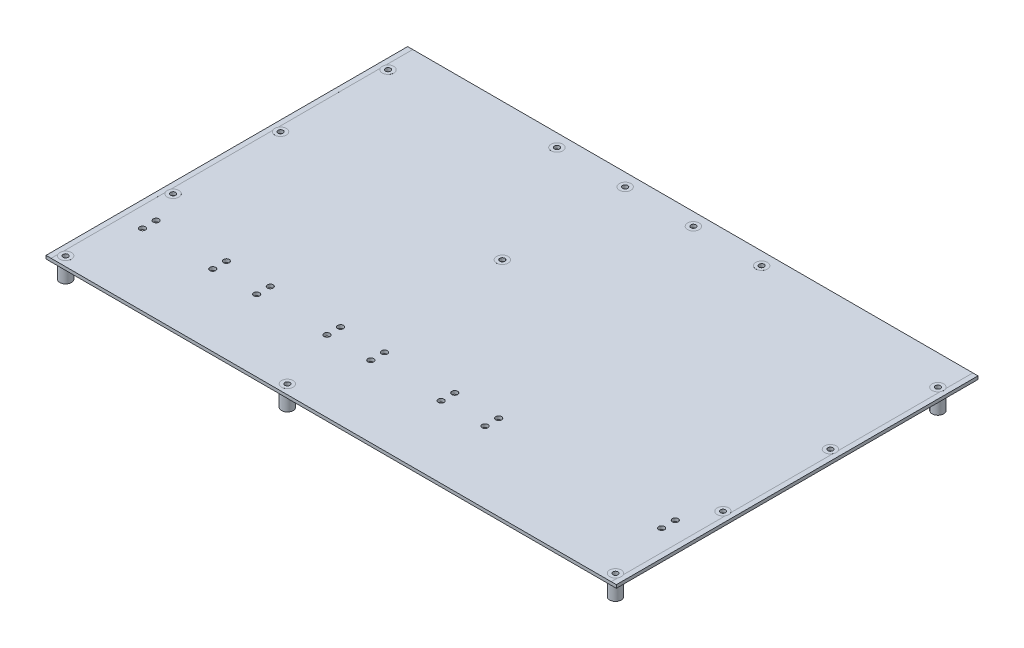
ISO-10303-21;
HEADER;
FILE_DESCRIPTION(('STEP AP214'),'2;1');
FILE_NAME('part.step','',(''),(''),'','','');
FILE_SCHEMA(('AUTOMOTIVE_DESIGN { 1 0 10303 214 1 1 1 1 }'));
ENDSEC;
DATA;
#1=APPLICATION_CONTEXT('core data for automotive mechanical design processes');
#2=APPLICATION_PROTOCOL_DEFINITION('international standard','automotive_design',2000,#1);
#3=PRODUCT_CONTEXT('',#1,'mechanical');
#4=PRODUCT('Part','Part','',(#3));
#5=PRODUCT_RELATED_PRODUCT_CATEGORY('part','',(#4));
#6=PRODUCT_DEFINITION_FORMATION('','',#4);
#7=PRODUCT_DEFINITION_CONTEXT('part definition',#1,'design');
#8=PRODUCT_DEFINITION('design','',#6,#7);
#9=PRODUCT_DEFINITION_SHAPE('','',#8);
#10=(LENGTH_UNIT() NAMED_UNIT(*) SI_UNIT(.MILLI.,.METRE.));
#11=(NAMED_UNIT(*) PLANE_ANGLE_UNIT() SI_UNIT($,.RADIAN.));
#12=(NAMED_UNIT(*) SI_UNIT($,.STERADIAN.) SOLID_ANGLE_UNIT());
#13=UNCERTAINTY_MEASURE_WITH_UNIT(LENGTH_MEASURE(1.E-05),#10,'distance_accuracy_value','');
#14=(GEOMETRIC_REPRESENTATION_CONTEXT(3) GLOBAL_UNCERTAINTY_ASSIGNED_CONTEXT((#13)) GLOBAL_UNIT_ASSIGNED_CONTEXT((#10,
#11,#12)) REPRESENTATION_CONTEXT('',''));
#15=CARTESIAN_POINT('',(0.,0.,0.));
#16=DIRECTION('',(0.,0.,1.));
#17=DIRECTION('',(1.,0.,0.));
#18=AXIS2_PLACEMENT_3D('',#15,#16,#17);
#19=CARTESIAN_POINT('',(-172.72,2.3622,0.));
#20=DIRECTION('',(0.,-1.,0.));
#21=DIRECTION('',(0.,0.,-1.));
#22=AXIS2_PLACEMENT_3D('',#19,#20,#21);
#23=PLANE('',#22);
#24=CARTESIAN_POINT('',(49.53,2.3622,9.525));
#25=DIRECTION('',(0.,-1.,0.));
#26=DIRECTION('',(0.,0.,-1.));
#27=AXIS2_PLACEMENT_3D('',#24,#25,#26);
#28=CIRCLE('',#27,4.318);
#29=CARTESIAN_POINT('',(49.53,2.3622,5.207));
#30=VERTEX_POINT('',#29);
#31=EDGE_CURVE('E847',#30,#30,#28,.F.);
#32=ORIENTED_EDGE('',*,*,#31,.F.);
#33=EDGE_LOOP('',(#32));
#34=FACE_BOUND('',#33,.T.);
#35=CARTESIAN_POINT('',(-52.07,2.3622,9.525));
#36=DIRECTION('',(0.,-1.,0.));
#37=DIRECTION('',(0.,0.,-1.));
#38=AXIS2_PLACEMENT_3D('',#35,#36,#37);
#39=CIRCLE('',#38,4.318);
#40=CARTESIAN_POINT('',(-52.07,2.3622,5.207));
#41=VERTEX_POINT('',#40);
#42=EDGE_CURVE('E531',#41,#41,#39,.F.);
#43=ORIENTED_EDGE('',*,*,#42,.F.);
#44=EDGE_LOOP('',(#43));
#45=FACE_BOUND('',#44,.T.);
#46=CARTESIAN_POINT('',(100.8174,2.3622,205.779379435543));
#47=DIRECTION('',(0.,-1.,0.));
#48=DIRECTION('',(0.,0.,-1.));
#49=AXIS2_PLACEMENT_3D('',#46,#47,#48);
#50=CIRCLE('',#49,2.159);
#51=CARTESIAN_POINT('',(100.8174,2.3622,203.620379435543));
#52=VERTEX_POINT('',#51);
#53=EDGE_CURVE('E512',#52,#52,#50,.T.);
#54=ORIENTED_EDGE('',*,*,#53,.T.);
#55=EDGE_LOOP('',(#54));
#56=FACE_BOUND('',#55,.T.);
#57=CARTESIAN_POINT('',(100.8174,2.3622,215.939379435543));
#58=DIRECTION('',(0.,-1.,0.));
#59=DIRECTION('',(0.,0.,-1.));
#60=AXIS2_PLACEMENT_3D('',#57,#58,#59);
#61=CIRCLE('',#60,2.159);
#62=CARTESIAN_POINT('',(100.8174,2.3622,213.780379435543));
#63=VERTEX_POINT('',#62);
#64=EDGE_CURVE('E538',#63,#63,#61,.T.);
#65=ORIENTED_EDGE('',*,*,#64,.T.);
#66=EDGE_LOOP('',(#65));
#67=FACE_BOUND('',#66,.T.);
#68=CARTESIAN_POINT('',(68.1414,2.3622,205.779379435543));
#69=DIRECTION('',(0.,-1.,0.));
#70=DIRECTION('',(0.,0.,-1.));
#71=AXIS2_PLACEMENT_3D('',#68,#69,#70);
#72=CIRCLE('',#71,2.159);
#73=CARTESIAN_POINT('',(68.1414,2.3622,203.620379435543));
#74=VERTEX_POINT('',#73);
#75=EDGE_CURVE('E539',#74,#74,#72,.T.);
#76=ORIENTED_EDGE('',*,*,#75,.T.);
#77=EDGE_LOOP('',(#76));
#78=FACE_BOUND('',#77,.T.);
#79=CARTESIAN_POINT('',(68.1414,2.3622,215.939379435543));
#80=DIRECTION('',(0.,-1.,0.));
#81=DIRECTION('',(0.,0.,-1.));
#82=AXIS2_PLACEMENT_3D('',#79,#80,#81);
#83=CIRCLE('',#82,2.159);
#84=CARTESIAN_POINT('',(68.1414,2.3622,213.780379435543));
#85=VERTEX_POINT('',#84);
#86=EDGE_CURVE('E542',#85,#85,#83,.T.);
#87=ORIENTED_EDGE('',*,*,#86,.T.);
#88=EDGE_LOOP('',(#87));
#89=FACE_BOUND('',#88,.T.);
#90=CARTESIAN_POINT('',(15.8174,2.3622,205.779379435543));
#91=DIRECTION('',(0.,-1.,0.));
#92=DIRECTION('',(0.,0.,-1.));
#93=AXIS2_PLACEMENT_3D('',#90,#91,#92);
#94=CIRCLE('',#93,2.159);
#95=CARTESIAN_POINT('',(15.8174,2.3622,203.620379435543));
#96=VERTEX_POINT('',#95);
#97=EDGE_CURVE('E545',#96,#96,#94,.T.);
#98=ORIENTED_EDGE('',*,*,#97,.T.);
#99=EDGE_LOOP('',(#98));
#100=FACE_BOUND('',#99,.T.);
#101=CARTESIAN_POINT('',(15.8174,2.3622,215.939379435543));
#102=DIRECTION('',(0.,-1.,0.));
#103=DIRECTION('',(0.,0.,-1.));
#104=AXIS2_PLACEMENT_3D('',#101,#102,#103);
#105=CIRCLE('',#104,2.159);
#106=CARTESIAN_POINT('',(15.8174,2.3622,213.780379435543));
#107=VERTEX_POINT('',#106);
#108=EDGE_CURVE('E548',#107,#107,#105,.T.);
#109=ORIENTED_EDGE('',*,*,#108,.T.);
#110=EDGE_LOOP('',(#109));
#111=FACE_BOUND('',#110,.T.);
#112=CARTESIAN_POINT('',(-16.8586,2.3622,205.779379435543));
#113=DIRECTION('',(0.,-1.,0.));
#114=DIRECTION('',(0.,0.,-1.));
#115=AXIS2_PLACEMENT_3D('',#112,#113,#114);
#116=CIRCLE('',#115,2.159);
#117=CARTESIAN_POINT('',(-16.8586,2.3622,203.620379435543));
#118=VERTEX_POINT('',#117);
#119=EDGE_CURVE('E549',#118,#118,#116,.T.);
#120=ORIENTED_EDGE('',*,*,#119,.T.);
#121=EDGE_LOOP('',(#120));
#122=FACE_BOUND('',#121,.T.);
#123=CARTESIAN_POINT('',(-16.8586,2.3622,215.939379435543));
#124=DIRECTION('',(0.,-1.,0.));
#125=DIRECTION('',(0.,0.,-1.));
#126=AXIS2_PLACEMENT_3D('',#123,#124,#125);
#127=CIRCLE('',#126,2.159);
#128=CARTESIAN_POINT('',(-16.8586,2.3622,213.780379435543));
#129=VERTEX_POINT('',#128);
#130=EDGE_CURVE('E552',#129,#129,#127,.T.);
#131=ORIENTED_EDGE('',*,*,#130,.T.);
#132=EDGE_LOOP('',(#131));
#133=FACE_BOUND('',#132,.T.);
#134=CARTESIAN_POINT('',(-69.1826,2.3622,205.779379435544));
#135=DIRECTION('',(0.,-1.,0.));
#136=DIRECTION('',(0.,0.,-1.));
#137=AXIS2_PLACEMENT_3D('',#134,#135,#136);
#138=CIRCLE('',#137,2.159);
#139=CARTESIAN_POINT('',(-69.1826,2.3622,203.620379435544));
#140=VERTEX_POINT('',#139);
#141=EDGE_CURVE('E555',#140,#140,#138,.T.);
#142=ORIENTED_EDGE('',*,*,#141,.T.);
#143=EDGE_LOOP('',(#142));
#144=FACE_BOUND('',#143,.T.);
#145=CARTESIAN_POINT('',(-69.1826,2.3622,215.939379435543));
#146=DIRECTION('',(0.,-1.,0.));
#147=DIRECTION('',(0.,0.,-1.));
#148=AXIS2_PLACEMENT_3D('',#145,#146,#147);
#149=CIRCLE('',#148,2.159);
#150=CARTESIAN_POINT('',(-69.1826,2.3622,213.780379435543));
#151=VERTEX_POINT('',#150);
#152=EDGE_CURVE('E558',#151,#151,#149,.T.);
#153=ORIENTED_EDGE('',*,*,#152,.T.);
#154=EDGE_LOOP('',(#153));
#155=FACE_BOUND('',#154,.T.);
#156=CARTESIAN_POINT('',(-101.8586,2.3622,215.939379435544));
#157=DIRECTION('',(0.,-1.,0.));
#158=DIRECTION('',(0.,0.,-1.));
#159=AXIS2_PLACEMENT_3D('',#156,#157,#158);
#160=CIRCLE('',#159,2.159);
#161=CARTESIAN_POINT('',(-101.8586,2.3622,213.780379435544));
#162=VERTEX_POINT('',#161);
#163=EDGE_CURVE('E561',#162,#162,#160,.T.);
#164=ORIENTED_EDGE('',*,*,#163,.T.);
#165=EDGE_LOOP('',(#164));
#166=FACE_BOUND('',#165,.T.);
#167=CARTESIAN_POINT('',(-154.1826,2.3622,215.939379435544));
#168=DIRECTION('',(0.,-1.,0.));
#169=DIRECTION('',(0.,0.,-1.));
#170=AXIS2_PLACEMENT_3D('',#167,#168,#169);
#171=CIRCLE('',#170,2.159);
#172=CARTESIAN_POINT('',(-154.1826,2.3622,213.780379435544));
#173=VERTEX_POINT('',#172);
#174=EDGE_CURVE('E578',#173,#173,#171,.T.);
#175=ORIENTED_EDGE('',*,*,#174,.T.);
#176=EDGE_LOOP('',(#175));
#177=FACE_BOUND('',#176,.T.);
#178=CARTESIAN_POINT('',(0.,2.3622,102.235));
#179=DIRECTION('',(0.,-1.,0.));
#180=DIRECTION('',(0.,0.,-1.));
#181=AXIS2_PLACEMENT_3D('',#178,#179,#180);
#182=CIRCLE('',#181,4.318);
#183=CARTESIAN_POINT('',(0.,2.3622,97.917));
#184=VERTEX_POINT('',#183);
#185=EDGE_CURVE('E669',#184,#184,#182,.F.);
#186=ORIENTED_EDGE('',*,*,#185,.F.);
#187=EDGE_LOOP('',(#186));
#188=FACE_BOUND('',#187,.T.);
#189=CARTESIAN_POINT('',(0.,2.3622,262.255));
#190=DIRECTION('',(0.,-1.,0.));
#191=DIRECTION('',(0.,0.,-1.));
#192=AXIS2_PLACEMENT_3D('',#189,#190,#191);
#193=CIRCLE('',#192,4.318);
#194=CARTESIAN_POINT('',(0.,2.3622,257.937));
#195=VERTEX_POINT('',#194);
#196=EDGE_CURVE('E601',#195,#195,#193,.F.);
#197=ORIENTED_EDGE('',*,*,#196,.F.);
#198=EDGE_LOOP('',(#197));
#199=FACE_BOUND('',#198,.T.);
#200=DIRECTION('',(1.,0.,0.));
#201=VECTOR('',#200,1.);
#202=CARTESIAN_POINT('',(-172.72,2.3622,269.24));
#203=LINE('',#202,#201);
#204=CARTESIAN_POINT('',(-168.91,2.3622,269.24));
#205=VERTEX_POINT('',#204);
#206=CARTESIAN_POINT('',(248.077170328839,2.3622,269.24));
#207=VERTEX_POINT('',#206);
#208=EDGE_CURVE('E581',#205,#207,#203,.T.);
#209=ORIENTED_EDGE('',*,*,#208,.T.);
#210=DIRECTION('',(0.,0.,1.));
#211=VECTOR('',#210,1.);
#212=CARTESIAN_POINT('',(248.077170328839,2.3622,0.));
#213=LINE('',#212,#211);
#214=CARTESIAN_POINT('',(248.077170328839,2.3622,264.287));
#215=VERTEX_POINT('',#214);
#216=EDGE_CURVE('E397',#215,#207,#213,.T.);
#217=ORIENTED_EDGE('',*,*,#216,.F.);
#218=CARTESIAN_POINT('',(244.267170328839,2.3622,262.255));
#219=DIRECTION('',(0.,-1.,0.));
#220=DIRECTION('',(0.,0.,-1.));
#221=AXIS2_PLACEMENT_3D('',#218,#219,#220);
#222=CIRCLE('',#221,4.318);
#223=CARTESIAN_POINT('',(248.077170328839,2.3622,260.223));
#224=VERTEX_POINT('',#223);
#225=EDGE_CURVE('E498',#224,#215,#222,.F.);
#226=ORIENTED_EDGE('',*,*,#225,.F.);
#227=CARTESIAN_POINT('',(248.077170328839,2.3622,184.277));
#228=VERTEX_POINT('',#227);
#229=EDGE_CURVE('E393',#228,#224,#213,.T.);
#230=ORIENTED_EDGE('',*,*,#229,.F.);
#231=CARTESIAN_POINT('',(244.267170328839,2.3622,182.245));
#232=DIRECTION('',(0.,-1.,0.));
#233=DIRECTION('',(0.,0.,-1.));
#234=AXIS2_PLACEMENT_3D('',#231,#232,#233);
#235=CIRCLE('',#234,4.318);
#236=CARTESIAN_POINT('',(248.077170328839,2.3622,180.213));
#237=VERTEX_POINT('',#236);
#238=EDGE_CURVE('E495',#237,#228,#235,.F.);
#239=ORIENTED_EDGE('',*,*,#238,.F.);
#240=CARTESIAN_POINT('',(248.077170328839,2.3622,104.267));
#241=VERTEX_POINT('',#240);
#242=EDGE_CURVE('E410',#241,#237,#213,.T.);
#243=ORIENTED_EDGE('',*,*,#242,.F.);
#244=CARTESIAN_POINT('',(244.267170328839,2.3622,102.235));
#245=DIRECTION('',(0.,-1.,0.));
#246=DIRECTION('',(0.,0.,-1.));
#247=AXIS2_PLACEMENT_3D('',#244,#245,#246);
#248=CIRCLE('',#247,4.318);
#249=CARTESIAN_POINT('',(248.077170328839,2.3622,100.203));
#250=VERTEX_POINT('',#249);
#251=EDGE_CURVE('E492',#250,#241,#248,.F.);
#252=ORIENTED_EDGE('',*,*,#251,.F.);
#253=CARTESIAN_POINT('',(248.077170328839,2.3622,24.257));
#254=VERTEX_POINT('',#253);
#255=EDGE_CURVE('E422',#254,#250,#213,.T.);
#256=ORIENTED_EDGE('',*,*,#255,.F.);
#257=CARTESIAN_POINT('',(244.267170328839,2.3622,22.225));
#258=DIRECTION('',(0.,-1.,0.));
#259=DIRECTION('',(0.,0.,-1.));
#260=AXIS2_PLACEMENT_3D('',#257,#258,#259);
#261=CIRCLE('',#260,4.318);
#262=CARTESIAN_POINT('',(248.077170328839,2.3622,20.193));
#263=VERTEX_POINT('',#262);
#264=EDGE_CURVE('E489',#263,#254,#261,.F.);
#265=ORIENTED_EDGE('',*,*,#264,.F.);
#266=CARTESIAN_POINT('',(248.077170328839,2.3622,0.));
#267=VERTEX_POINT('',#266);
#268=EDGE_CURVE('E396',#267,#263,#213,.T.);
#269=ORIENTED_EDGE('',*,*,#268,.F.);
#270=DIRECTION('',(-1.,0.,0.));
#271=VECTOR('',#270,1.);
#272=CARTESIAN_POINT('',(-172.72,2.3622,0.));
#273=LINE('',#272,#271);
#274=CARTESIAN_POINT('',(-168.91,2.3622,0.));
#275=VERTEX_POINT('',#274);
#276=EDGE_CURVE('E574',#267,#275,#273,.T.);
#277=ORIENTED_EDGE('',*,*,#276,.T.);
#278=DIRECTION('',(0.,0.,-1.));
#279=VECTOR('',#278,1.);
#280=CARTESIAN_POINT('',(-168.91,2.3622,0.));
#281=LINE('',#280,#279);
#282=CARTESIAN_POINT('',(-168.91,2.3622,20.193));
#283=VERTEX_POINT('',#282);
#284=EDGE_CURVE('E707',#283,#275,#281,.T.);
#285=ORIENTED_EDGE('',*,*,#284,.F.);
#286=CARTESIAN_POINT('',(-165.1,2.3622,22.225));
#287=DIRECTION('',(0.,-1.,0.));
#288=DIRECTION('',(0.,0.,-1.));
#289=AXIS2_PLACEMENT_3D('',#286,#287,#288);
#290=CIRCLE('',#289,4.318);
#291=CARTESIAN_POINT('',(-168.91,2.3622,24.257));
#292=VERTEX_POINT('',#291);
#293=EDGE_CURVE('E621',#292,#283,#290,.F.);
#294=ORIENTED_EDGE('',*,*,#293,.F.);
#295=CARTESIAN_POINT('',(-168.91,2.3622,100.203));
#296=VERTEX_POINT('',#295);
#297=EDGE_CURVE('E730',#296,#292,#281,.T.);
#298=ORIENTED_EDGE('',*,*,#297,.F.);
#299=CARTESIAN_POINT('',(-165.1,2.3622,102.235));
#300=DIRECTION('',(0.,-1.,0.));
#301=DIRECTION('',(0.,0.,-1.));
#302=AXIS2_PLACEMENT_3D('',#299,#300,#301);
#303=CIRCLE('',#302,4.318);
#304=CARTESIAN_POINT('',(-168.91,2.3622,104.267));
#305=VERTEX_POINT('',#304);
#306=EDGE_CURVE('E643',#305,#296,#303,.F.);
#307=ORIENTED_EDGE('',*,*,#306,.F.);
#308=CARTESIAN_POINT('',(-168.91,2.3622,180.213));
#309=VERTEX_POINT('',#308);
#310=EDGE_CURVE('E589',#309,#305,#281,.T.);
#311=ORIENTED_EDGE('',*,*,#310,.F.);
#312=CARTESIAN_POINT('',(-165.1,2.3622,182.245));
#313=DIRECTION('',(0.,-1.,0.));
#314=DIRECTION('',(0.,0.,-1.));
#315=AXIS2_PLACEMENT_3D('',#312,#313,#314);
#316=CIRCLE('',#315,4.318);
#317=CARTESIAN_POINT('',(-168.91,2.3622,184.277));
#318=VERTEX_POINT('',#317);
#319=EDGE_CURVE('E600',#318,#309,#316,.F.);
#320=ORIENTED_EDGE('',*,*,#319,.F.);
#321=CARTESIAN_POINT('',(-168.91,2.3622,260.223));
#322=VERTEX_POINT('',#321);
#323=EDGE_CURVE('E594',#322,#318,#281,.T.);
#324=ORIENTED_EDGE('',*,*,#323,.F.);
#325=CARTESIAN_POINT('',(-165.1,2.3622,262.255));
#326=DIRECTION('',(0.,-1.,0.));
#327=DIRECTION('',(0.,0.,-1.));
#328=AXIS2_PLACEMENT_3D('',#325,#326,#327);
#329=CIRCLE('',#328,4.318);
#330=CARTESIAN_POINT('',(-168.91,2.3622,264.287));
#331=VERTEX_POINT('',#330);
#332=EDGE_CURVE('E599',#331,#322,#329,.F.);
#333=ORIENTED_EDGE('',*,*,#332,.F.);
#334=EDGE_CURVE('E595',#205,#331,#281,.T.);
#335=ORIENTED_EDGE('',*,*,#334,.F.);
#336=EDGE_LOOP('',(#209,#217,#226,#230,#239,#243,#252,#256,#265,#269,#277,#285,#294,#298,#307,
#311,#320,#324,#333,#335));
#337=FACE_BOUND('',#336,.T.);
#338=CARTESIAN_POINT('',(-154.1826,2.3622,205.779379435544));
#339=DIRECTION('',(0.,-1.,0.));
#340=DIRECTION('',(0.,0.,-1.));
#341=AXIS2_PLACEMENT_3D('',#338,#339,#340);
#342=CIRCLE('',#341,2.159);
#343=CARTESIAN_POINT('',(-154.1826,2.3622,203.620379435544));
#344=VERTEX_POINT('',#343);
#345=EDGE_CURVE('E566',#344,#344,#342,.T.);
#346=ORIENTED_EDGE('',*,*,#345,.T.);
#347=EDGE_LOOP('',(#346));
#348=FACE_BOUND('',#347,.T.);
#349=CARTESIAN_POINT('',(-101.8586,2.3622,205.779379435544));
#350=DIRECTION('',(0.,-1.,0.));
#351=DIRECTION('',(0.,0.,-1.));
#352=AXIS2_PLACEMENT_3D('',#349,#350,#351);
#353=CIRCLE('',#352,2.159);
#354=CARTESIAN_POINT('',(-101.8586,2.3622,203.620379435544));
#355=VERTEX_POINT('',#354);
#356=EDGE_CURVE('E562',#355,#355,#353,.T.);
#357=ORIENTED_EDGE('',*,*,#356,.T.);
#358=EDGE_LOOP('',(#357));
#359=FACE_BOUND('',#358,.T.);
#360=CARTESIAN_POINT('',(-1.27,2.3622,9.525));
#361=DIRECTION('',(0.,-1.,0.));
#362=DIRECTION('',(0.,0.,-1.));
#363=AXIS2_PLACEMENT_3D('',#360,#361,#362);
#364=CIRCLE('',#363,4.318);
#365=CARTESIAN_POINT('',(-1.27,2.3622,5.207));
#366=VERTEX_POINT('',#365);
#367=EDGE_CURVE('E840',#366,#366,#364,.F.);
#368=ORIENTED_EDGE('',*,*,#367,.F.);
#369=EDGE_LOOP('',(#368));
#370=FACE_BOUND('',#369,.T.);
#371=CARTESIAN_POINT('',(100.33,2.3622,9.525));
#372=DIRECTION('',(0.,-1.,0.));
#373=DIRECTION('',(0.,0.,-1.));
#374=AXIS2_PLACEMENT_3D('',#371,#372,#373);
#375=CIRCLE('',#374,4.318);
#376=CARTESIAN_POINT('',(100.33,2.3622,5.207));
#377=VERTEX_POINT('',#376);
#378=EDGE_CURVE('E857',#377,#377,#375,.F.);
#379=ORIENTED_EDGE('',*,*,#378,.F.);
#380=EDGE_LOOP('',(#379));
#381=FACE_BOUND('',#380,.T.);
#382=CARTESIAN_POINT('',(232.308570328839,2.3622,215.939379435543));
#383=DIRECTION('',(0.,-1.,0.));
#384=DIRECTION('',(0.,0.,-1.));
#385=AXIS2_PLACEMENT_3D('',#382,#383,#384);
#386=CIRCLE('',#385,2.159);
#387=CARTESIAN_POINT('',(232.308570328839,2.3622,213.780379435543));
#388=VERTEX_POINT('',#387);
#389=EDGE_CURVE('E345',#388,#388,#386,.T.);
#390=ORIENTED_EDGE('',*,*,#389,.T.);
#391=EDGE_LOOP('',(#390));
#392=FACE_BOUND('',#391,.T.);
#393=CARTESIAN_POINT('',(232.308570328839,2.3622,205.779379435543));
#394=DIRECTION('',(0.,-1.,0.));
#395=DIRECTION('',(0.,0.,-1.));
#396=AXIS2_PLACEMENT_3D('',#393,#394,#395);
#397=CIRCLE('',#396,2.159);
#398=CARTESIAN_POINT('',(232.308570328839,2.3622,203.620379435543));
#399=VERTEX_POINT('',#398);
#400=EDGE_CURVE('E514',#399,#399,#397,.T.);
#401=ORIENTED_EDGE('',*,*,#400,.T.);
#402=EDGE_LOOP('',(#401));
#403=FACE_BOUND('',#402,.T.);
#404=ADVANCED_FACE('F38',(#34,#45,#56,#67,#78,#89,#100,#111,#122,#133,#144,#155,#166,#177,#188,
#199,#337,#348,#359,#370,#381,#392,#403),#23,.F.);
#405=CARTESIAN_POINT('',(-172.72,0.,0.));
#406=DIRECTION('',(0.,-1.,0.));
#407=DIRECTION('',(0.,0.,-1.));
#408=AXIS2_PLACEMENT_3D('',#405,#406,#407);
#409=PLANE('',#408);
#410=DIRECTION('',(-1.,0.,0.));
#411=VECTOR('',#410,1.);
#412=CARTESIAN_POINT('',(-172.72,0.,0.));
#413=LINE('',#412,#411);
#414=CARTESIAN_POINT('',(248.077170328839,0.,0.));
#415=VERTEX_POINT('',#414);
#416=CARTESIAN_POINT('',(-168.91,0.,0.));
#417=VERTEX_POINT('',#416);
#418=EDGE_CURVE('E786',#415,#417,#413,.T.);
#419=ORIENTED_EDGE('',*,*,#418,.F.);
#420=DIRECTION('',(0.,0.,1.));
#421=VECTOR('',#420,1.);
#422=CARTESIAN_POINT('',(248.077170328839,0.,0.));
#423=LINE('',#422,#421);
#424=CARTESIAN_POINT('',(248.077170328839,0.,20.193));
#425=VERTEX_POINT('',#424);
#426=EDGE_CURVE('E323',#415,#425,#423,.T.);
#427=ORIENTED_EDGE('',*,*,#426,.T.);
#428=CARTESIAN_POINT('',(244.267170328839,0.,22.225));
#429=DIRECTION('',(0.,-1.,0.));
#430=DIRECTION('',(0.,0.,-1.));
#431=AXIS2_PLACEMENT_3D('',#428,#429,#430);
#432=CIRCLE('',#431,4.318);
#433=CARTESIAN_POINT('',(248.077170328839,0.,24.257));
#434=VERTEX_POINT('',#433);
#435=EDGE_CURVE('E483',#425,#434,#432,.F.);
#436=ORIENTED_EDGE('',*,*,#435,.T.);
#437=CARTESIAN_POINT('',(248.077170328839,0.,100.203));
#438=VERTEX_POINT('',#437);
#439=EDGE_CURVE('E416',#434,#438,#423,.T.);
#440=ORIENTED_EDGE('',*,*,#439,.T.);
#441=CARTESIAN_POINT('',(244.267170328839,0.,102.235));
#442=DIRECTION('',(0.,-1.,0.));
#443=DIRECTION('',(0.,0.,-1.));
#444=AXIS2_PLACEMENT_3D('',#441,#442,#443);
#445=CIRCLE('',#444,4.318);
#446=CARTESIAN_POINT('',(248.077170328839,0.,104.267));
#447=VERTEX_POINT('',#446);
#448=EDGE_CURVE('E477',#438,#447,#445,.F.);
#449=ORIENTED_EDGE('',*,*,#448,.T.);
#450=CARTESIAN_POINT('',(248.077170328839,0.,180.213));
#451=VERTEX_POINT('',#450);
#452=EDGE_CURVE('E404',#447,#451,#423,.T.);
#453=ORIENTED_EDGE('',*,*,#452,.T.);
#454=CARTESIAN_POINT('',(244.267170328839,0.,182.245));
#455=DIRECTION('',(0.,-1.,0.));
#456=DIRECTION('',(0.,0.,-1.));
#457=AXIS2_PLACEMENT_3D('',#454,#455,#456);
#458=CIRCLE('',#457,4.318);
#459=CARTESIAN_POINT('',(248.077170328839,0.,184.277));
#460=VERTEX_POINT('',#459);
#461=EDGE_CURVE('E468',#451,#460,#458,.F.);
#462=ORIENTED_EDGE('',*,*,#461,.T.);
#463=CARTESIAN_POINT('',(248.077170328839,0.,260.223));
#464=VERTEX_POINT('',#463);
#465=EDGE_CURVE('E384',#460,#464,#423,.T.);
#466=ORIENTED_EDGE('',*,*,#465,.T.);
#467=CARTESIAN_POINT('',(244.267170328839,0.,262.255));
#468=DIRECTION('',(0.,-1.,0.));
#469=DIRECTION('',(0.,0.,-1.));
#470=AXIS2_PLACEMENT_3D('',#467,#468,#469);
#471=CIRCLE('',#470,4.318);
#472=CARTESIAN_POINT('',(248.077170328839,0.,264.287));
#473=VERTEX_POINT('',#472);
#474=EDGE_CURVE('E459',#464,#473,#471,.F.);
#475=ORIENTED_EDGE('',*,*,#474,.T.);
#476=CARTESIAN_POINT('',(248.077170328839,0.,269.24));
#477=VERTEX_POINT('',#476);
#478=EDGE_CURVE('E387',#473,#477,#423,.T.);
#479=ORIENTED_EDGE('',*,*,#478,.T.);
#480=DIRECTION('',(1.,0.,0.));
#481=VECTOR('',#480,1.);
#482=CARTESIAN_POINT('',(-172.72,0.,269.24));
#483=LINE('',#482,#481);
#484=CARTESIAN_POINT('',(-168.91,0.,269.24));
#485=VERTEX_POINT('',#484);
#486=EDGE_CURVE('E41',#485,#477,#483,.T.);
#487=ORIENTED_EDGE('',*,*,#486,.F.);
#488=DIRECTION('',(0.,0.,-1.));
#489=VECTOR('',#488,1.);
#490=CARTESIAN_POINT('',(-168.91,0.,0.));
#491=LINE('',#490,#489);
#492=CARTESIAN_POINT('',(-168.91,0.,264.287));
#493=VERTEX_POINT('',#492);
#494=EDGE_CURVE('E565',#485,#493,#491,.T.);
#495=ORIENTED_EDGE('',*,*,#494,.T.);
#496=CARTESIAN_POINT('',(-165.1,0.,262.255));
#497=DIRECTION('',(0.,-1.,0.));
#498=DIRECTION('',(0.,0.,-1.));
#499=AXIS2_PLACEMENT_3D('',#496,#497,#498);
#500=CIRCLE('',#499,4.318);
#501=CARTESIAN_POINT('',(-168.91,0.,260.223));
#502=VERTEX_POINT('',#501);
#503=EDGE_CURVE('E609',#493,#502,#500,.F.);
#504=ORIENTED_EDGE('',*,*,#503,.T.);
#505=CARTESIAN_POINT('',(-168.91,0.,184.277));
#506=VERTEX_POINT('',#505);
#507=EDGE_CURVE('E612',#502,#506,#491,.T.);
#508=ORIENTED_EDGE('',*,*,#507,.T.);
#509=CARTESIAN_POINT('',(-165.1,0.,182.245));
#510=DIRECTION('',(0.,-1.,0.));
#511=DIRECTION('',(0.,0.,-1.));
#512=AXIS2_PLACEMENT_3D('',#509,#510,#511);
#513=CIRCLE('',#512,4.318);
#514=CARTESIAN_POINT('',(-168.91,0.,180.213));
#515=VERTEX_POINT('',#514);
#516=EDGE_CURVE('E613',#506,#515,#513,.F.);
#517=ORIENTED_EDGE('',*,*,#516,.T.);
#518=CARTESIAN_POINT('',(-168.91,0.,104.267));
#519=VERTEX_POINT('',#518);
#520=EDGE_CURVE('E616',#515,#519,#491,.T.);
#521=ORIENTED_EDGE('',*,*,#520,.T.);
#522=CARTESIAN_POINT('',(-165.1,0.,102.235));
#523=DIRECTION('',(0.,-1.,0.));
#524=DIRECTION('',(0.,0.,-1.));
#525=AXIS2_PLACEMENT_3D('',#522,#523,#524);
#526=CIRCLE('',#525,4.318);
#527=CARTESIAN_POINT('',(-168.91,0.,100.203));
#528=VERTEX_POINT('',#527);
#529=EDGE_CURVE('E617',#519,#528,#526,.F.);
#530=ORIENTED_EDGE('',*,*,#529,.T.);
#531=CARTESIAN_POINT('',(-168.91,0.,24.257));
#532=VERTEX_POINT('',#531);
#533=EDGE_CURVE('E620',#528,#532,#491,.T.);
#534=ORIENTED_EDGE('',*,*,#533,.T.);
#535=CARTESIAN_POINT('',(-165.1,0.,22.225));
#536=DIRECTION('',(0.,-1.,0.));
#537=DIRECTION('',(0.,0.,-1.));
#538=AXIS2_PLACEMENT_3D('',#535,#536,#537);
#539=CIRCLE('',#538,4.318);
#540=CARTESIAN_POINT('',(-168.91,0.,20.193));
#541=VERTEX_POINT('',#540);
#542=EDGE_CURVE('E632',#532,#541,#539,.F.);
#543=ORIENTED_EDGE('',*,*,#542,.T.);
#544=EDGE_CURVE('E527',#541,#417,#491,.T.);
#545=ORIENTED_EDGE('',*,*,#544,.T.);
#546=EDGE_LOOP('',(#419,#427,#436,#440,#449,#453,#462,#466,#475,#479,#487,#495,#504,#508,#517,
#521,#530,#534,#543,#545));
#547=FACE_BOUND('',#546,.T.);
#548=CARTESIAN_POINT('',(49.53,0.,9.525));
#549=DIRECTION('',(0.,-1.,0.));
#550=DIRECTION('',(0.,0.,-1.));
#551=AXIS2_PLACEMENT_3D('',#548,#549,#550);
#552=CIRCLE('',#551,4.318);
#553=CARTESIAN_POINT('',(49.53,0.,5.207));
#554=VERTEX_POINT('',#553);
#555=EDGE_CURVE('E523',#554,#554,#552,.F.);
#556=ORIENTED_EDGE('',*,*,#555,.T.);
#557=EDGE_LOOP('',(#556));
#558=FACE_BOUND('',#557,.T.);
#559=CARTESIAN_POINT('',(-52.07,0.,9.525));
#560=DIRECTION('',(0.,-1.,0.));
#561=DIRECTION('',(0.,0.,-1.));
#562=AXIS2_PLACEMENT_3D('',#559,#560,#561);
#563=CIRCLE('',#562,4.318);
#564=CARTESIAN_POINT('',(-52.07,0.,5.207));
#565=VERTEX_POINT('',#564);
#566=EDGE_CURVE('E526',#565,#565,#563,.F.);
#567=ORIENTED_EDGE('',*,*,#566,.T.);
#568=EDGE_LOOP('',(#567));
#569=FACE_BOUND('',#568,.T.);
#570=CARTESIAN_POINT('',(100.8174,0.,205.779379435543));
#571=DIRECTION('',(0.,-1.,0.));
#572=DIRECTION('',(0.,0.,-1.));
#573=AXIS2_PLACEMENT_3D('',#570,#571,#572);
#574=CIRCLE('',#573,2.159);
#575=CARTESIAN_POINT('',(100.8174,0.,203.620379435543));
#576=VERTEX_POINT('',#575);
#577=EDGE_CURVE('E825',#576,#576,#574,.T.);
#578=ORIENTED_EDGE('',*,*,#577,.F.);
#579=EDGE_LOOP('',(#578));
#580=FACE_BOUND('',#579,.T.);
#581=CARTESIAN_POINT('',(100.8174,0.,215.939379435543));
#582=DIRECTION('',(0.,-1.,0.));
#583=DIRECTION('',(0.,0.,-1.));
#584=AXIS2_PLACEMENT_3D('',#581,#582,#583);
#585=CIRCLE('',#584,2.159);
#586=CARTESIAN_POINT('',(100.8174,0.,213.780379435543));
#587=VERTEX_POINT('',#586);
#588=EDGE_CURVE('E820',#587,#587,#585,.T.);
#589=ORIENTED_EDGE('',*,*,#588,.F.);
#590=EDGE_LOOP('',(#589));
#591=FACE_BOUND('',#590,.T.);
#592=CARTESIAN_POINT('',(68.1414,0.,205.779379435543));
#593=DIRECTION('',(0.,-1.,0.));
#594=DIRECTION('',(0.,0.,-1.));
#595=AXIS2_PLACEMENT_3D('',#592,#593,#594);
#596=CIRCLE('',#595,2.159);
#597=CARTESIAN_POINT('',(68.1414,0.,203.620379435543));
#598=VERTEX_POINT('',#597);
#599=EDGE_CURVE('E817',#598,#598,#596,.T.);
#600=ORIENTED_EDGE('',*,*,#599,.F.);
#601=EDGE_LOOP('',(#600));
#602=FACE_BOUND('',#601,.T.);
#603=CARTESIAN_POINT('',(68.1414,0.,215.939379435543));
#604=DIRECTION('',(0.,-1.,0.));
#605=DIRECTION('',(0.,0.,-1.));
#606=AXIS2_PLACEMENT_3D('',#603,#604,#605);
#607=CIRCLE('',#606,2.159);
#608=CARTESIAN_POINT('',(68.1414,0.,213.780379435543));
#609=VERTEX_POINT('',#608);
#610=EDGE_CURVE('E814',#609,#609,#607,.T.);
#611=ORIENTED_EDGE('',*,*,#610,.F.);
#612=EDGE_LOOP('',(#611));
#613=FACE_BOUND('',#612,.T.);
#614=CARTESIAN_POINT('',(15.8174,0.,205.779379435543));
#615=DIRECTION('',(0.,-1.,0.));
#616=DIRECTION('',(0.,0.,-1.));
#617=AXIS2_PLACEMENT_3D('',#614,#615,#616);
#618=CIRCLE('',#617,2.159);
#619=CARTESIAN_POINT('',(15.8174,0.,203.620379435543));
#620=VERTEX_POINT('',#619);
#621=EDGE_CURVE('E811',#620,#620,#618,.T.);
#622=ORIENTED_EDGE('',*,*,#621,.F.);
#623=EDGE_LOOP('',(#622));
#624=FACE_BOUND('',#623,.T.);
#625=CARTESIAN_POINT('',(15.8174,0.,215.939379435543));
#626=DIRECTION('',(0.,-1.,0.));
#627=DIRECTION('',(0.,0.,-1.));
#628=AXIS2_PLACEMENT_3D('',#625,#626,#627);
#629=CIRCLE('',#628,2.159);
#630=CARTESIAN_POINT('',(15.8174,0.,213.780379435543));
#631=VERTEX_POINT('',#630);
#632=EDGE_CURVE('E806',#631,#631,#629,.T.);
#633=ORIENTED_EDGE('',*,*,#632,.F.);
#634=EDGE_LOOP('',(#633));
#635=FACE_BOUND('',#634,.T.);
#636=CARTESIAN_POINT('',(-16.8586,0.,205.779379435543));
#637=DIRECTION('',(0.,-1.,0.));
#638=DIRECTION('',(0.,0.,-1.));
#639=AXIS2_PLACEMENT_3D('',#636,#637,#638);
#640=CIRCLE('',#639,2.159);
#641=CARTESIAN_POINT('',(-16.8586,0.,203.620379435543));
#642=VERTEX_POINT('',#641);
#643=EDGE_CURVE('E803',#642,#642,#640,.T.);
#644=ORIENTED_EDGE('',*,*,#643,.F.);
#645=EDGE_LOOP('',(#644));
#646=FACE_BOUND('',#645,.T.);
#647=CARTESIAN_POINT('',(-16.8586,0.,215.939379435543));
#648=DIRECTION('',(0.,-1.,0.));
#649=DIRECTION('',(0.,0.,-1.));
#650=AXIS2_PLACEMENT_3D('',#647,#648,#649);
#651=CIRCLE('',#650,2.159);
#652=CARTESIAN_POINT('',(-16.8586,0.,213.780379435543));
#653=VERTEX_POINT('',#652);
#654=EDGE_CURVE('E800',#653,#653,#651,.T.);
#655=ORIENTED_EDGE('',*,*,#654,.F.);
#656=EDGE_LOOP('',(#655));
#657=FACE_BOUND('',#656,.T.);
#658=CARTESIAN_POINT('',(-69.1826,0.,205.779379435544));
#659=DIRECTION('',(0.,-1.,0.));
#660=DIRECTION('',(0.,0.,-1.));
#661=AXIS2_PLACEMENT_3D('',#658,#659,#660);
#662=CIRCLE('',#661,2.159);
#663=CARTESIAN_POINT('',(-69.1826,0.,203.620379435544));
#664=VERTEX_POINT('',#663);
#665=EDGE_CURVE('E797',#664,#664,#662,.T.);
#666=ORIENTED_EDGE('',*,*,#665,.F.);
#667=EDGE_LOOP('',(#666));
#668=FACE_BOUND('',#667,.T.);
#669=CARTESIAN_POINT('',(-69.1826,0.,215.939379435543));
#670=DIRECTION('',(0.,-1.,0.));
#671=DIRECTION('',(0.,0.,-1.));
#672=AXIS2_PLACEMENT_3D('',#669,#670,#671);
#673=CIRCLE('',#672,2.159);
#674=CARTESIAN_POINT('',(-69.1826,0.,213.780379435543));
#675=VERTEX_POINT('',#674);
#676=EDGE_CURVE('E570',#675,#675,#673,.T.);
#677=ORIENTED_EDGE('',*,*,#676,.F.);
#678=EDGE_LOOP('',(#677));
#679=FACE_BOUND('',#678,.T.);
#680=CARTESIAN_POINT('',(-101.8586,0.,215.939379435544));
#681=DIRECTION('',(0.,-1.,0.));
#682=DIRECTION('',(0.,0.,-1.));
#683=AXIS2_PLACEMENT_3D('',#680,#681,#682);
#684=CIRCLE('',#683,2.159);
#685=CARTESIAN_POINT('',(-101.8586,0.,213.780379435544));
#686=VERTEX_POINT('',#685);
#687=EDGE_CURVE('E577',#686,#686,#684,.T.);
#688=ORIENTED_EDGE('',*,*,#687,.F.);
#689=EDGE_LOOP('',(#688));
#690=FACE_BOUND('',#689,.T.);
#691=CARTESIAN_POINT('',(-154.1826,0.,215.939379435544));
#692=DIRECTION('',(0.,-1.,0.));
#693=DIRECTION('',(0.,0.,-1.));
#694=AXIS2_PLACEMENT_3D('',#691,#692,#693);
#695=CIRCLE('',#694,2.159);
#696=CARTESIAN_POINT('',(-154.1826,0.,213.780379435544));
#697=VERTEX_POINT('',#696);
#698=EDGE_CURVE('E752',#697,#697,#695,.T.);
#699=ORIENTED_EDGE('',*,*,#698,.F.);
#700=EDGE_LOOP('',(#699));
#701=FACE_BOUND('',#700,.T.);
#702=CARTESIAN_POINT('',(0.,0.,102.235));
#703=DIRECTION('',(0.,-1.,0.));
#704=DIRECTION('',(0.,0.,-1.));
#705=AXIS2_PLACEMENT_3D('',#702,#703,#704);
#706=CIRCLE('',#705,4.318);
#707=CARTESIAN_POINT('',(0.,0.,97.917));
#708=VERTEX_POINT('',#707);
#709=EDGE_CURVE('E606',#708,#708,#706,.F.);
#710=ORIENTED_EDGE('',*,*,#709,.T.);
#711=EDGE_LOOP('',(#710));
#712=FACE_BOUND('',#711,.T.);
#713=CARTESIAN_POINT('',(0.,0.,262.255));
#714=DIRECTION('',(0.,-1.,0.));
#715=DIRECTION('',(0.,0.,-1.));
#716=AXIS2_PLACEMENT_3D('',#713,#714,#715);
#717=CIRCLE('',#716,4.318);
#718=CARTESIAN_POINT('',(0.,0.,257.937));
#719=VERTEX_POINT('',#718);
#720=EDGE_CURVE('E530',#719,#719,#717,.F.);
#721=ORIENTED_EDGE('',*,*,#720,.T.);
#722=EDGE_LOOP('',(#721));
#723=FACE_BOUND('',#722,.T.);
#724=CARTESIAN_POINT('',(-154.1826,0.,205.779379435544));
#725=DIRECTION('',(0.,-1.,0.));
#726=DIRECTION('',(0.,0.,-1.));
#727=AXIS2_PLACEMENT_3D('',#724,#725,#726);
#728=CIRCLE('',#727,2.159);
#729=CARTESIAN_POINT('',(-154.1826,0.,203.620379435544));
#730=VERTEX_POINT('',#729);
#731=EDGE_CURVE('E571',#730,#730,#728,.T.);
#732=ORIENTED_EDGE('',*,*,#731,.F.);
#733=EDGE_LOOP('',(#732));
#734=FACE_BOUND('',#733,.T.);
#735=CARTESIAN_POINT('',(-101.8586,0.,205.779379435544));
#736=DIRECTION('',(0.,-1.,0.));
#737=DIRECTION('',(0.,0.,-1.));
#738=AXIS2_PLACEMENT_3D('',#735,#736,#737);
#739=CIRCLE('',#738,2.159);
#740=CARTESIAN_POINT('',(-101.8586,0.,203.620379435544));
#741=VERTEX_POINT('',#740);
#742=EDGE_CURVE('E567',#741,#741,#739,.T.);
#743=ORIENTED_EDGE('',*,*,#742,.F.);
#744=EDGE_LOOP('',(#743));
#745=FACE_BOUND('',#744,.T.);
#746=CARTESIAN_POINT('',(-1.27,0.,9.525));
#747=DIRECTION('',(0.,-1.,0.));
#748=DIRECTION('',(0.,0.,-1.));
#749=AXIS2_PLACEMENT_3D('',#746,#747,#748);
#750=CIRCLE('',#749,4.318);
#751=CARTESIAN_POINT('',(-1.27,0.,5.207));
#752=VERTEX_POINT('',#751);
#753=EDGE_CURVE('E522',#752,#752,#750,.F.);
#754=ORIENTED_EDGE('',*,*,#753,.T.);
#755=EDGE_LOOP('',(#754));
#756=FACE_BOUND('',#755,.T.);
#757=CARTESIAN_POINT('',(100.33,0.,9.525));
#758=DIRECTION('',(0.,-1.,0.));
#759=DIRECTION('',(0.,0.,-1.));
#760=AXIS2_PLACEMENT_3D('',#757,#758,#759);
#761=CIRCLE('',#760,4.318);
#762=CARTESIAN_POINT('',(100.33,0.,5.207));
#763=VERTEX_POINT('',#762);
#764=EDGE_CURVE('E518',#763,#763,#761,.F.);
#765=ORIENTED_EDGE('',*,*,#764,.T.);
#766=EDGE_LOOP('',(#765));
#767=FACE_BOUND('',#766,.T.);
#768=CARTESIAN_POINT('',(232.308570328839,0.,215.939379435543));
#769=DIRECTION('',(0.,-1.,0.));
#770=DIRECTION('',(0.,0.,-1.));
#771=AXIS2_PLACEMENT_3D('',#768,#769,#770);
#772=CIRCLE('',#771,2.159);
#773=CARTESIAN_POINT('',(232.308570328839,0.,213.780379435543));
#774=VERTEX_POINT('',#773);
#775=EDGE_CURVE('E350',#774,#774,#772,.T.);
#776=ORIENTED_EDGE('',*,*,#775,.F.);
#777=EDGE_LOOP('',(#776));
#778=FACE_BOUND('',#777,.T.);
#779=CARTESIAN_POINT('',(232.308570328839,0.,205.779379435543));
#780=DIRECTION('',(0.,-1.,0.));
#781=DIRECTION('',(0.,0.,-1.));
#782=AXIS2_PLACEMENT_3D('',#779,#780,#781);
#783=CIRCLE('',#782,2.159);
#784=CARTESIAN_POINT('',(232.308570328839,0.,203.620379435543));
#785=VERTEX_POINT('',#784);
#786=EDGE_CURVE('E517',#785,#785,#783,.T.);
#787=ORIENTED_EDGE('',*,*,#786,.F.);
#788=EDGE_LOOP('',(#787));
#789=FACE_BOUND('',#788,.T.);
#790=ADVANCED_FACE('F1038',(#547,#558,#569,#580,#591,#602,#613,#624,#635,#646,#657,#668,#679,
#690,#701,#712,#723,#734,#745,#756,#767,#778,#789),#409,.T.);
#791=CARTESIAN_POINT('',(-165.1,2.3749,22.225));
#792=DIRECTION('',(0.,-1.,0.));
#793=DIRECTION('',(0.,0.,-1.));
#794=AXIS2_PLACEMENT_3D('',#791,#792,#793);
#795=CYLINDRICAL_SURFACE('',#794,4.318);
#796=CARTESIAN_POINT('',(-165.1,2.3749,22.225));
#797=DIRECTION('',(0.,1.,0.));
#798=DIRECTION('',(0.,0.,1.));
#799=AXIS2_PLACEMENT_3D('',#796,#797,#798);
#800=CIRCLE('',#799,4.318);
#801=CARTESIAN_POINT('',(-165.1,2.3749,26.543));
#802=VERTEX_POINT('',#801);
#803=EDGE_CURVE('E635',#802,#802,#800,.T.);
#804=ORIENTED_EDGE('',*,*,#803,.F.);
#805=EDGE_LOOP('',(#804));
#806=FACE_BOUND('',#805,.T.);
#807=DIRECTION('',(0.,-1.,0.));
#808=VECTOR('',#807,1.);
#809=CARTESIAN_POINT('',(-168.91,2.3749,20.193));
#810=LINE('',#809,#808);
#811=CARTESIAN_POINT('',(-168.91,2.36347,20.193));
#812=VERTEX_POINT('',#811);
#813=EDGE_CURVE('E713',#812,#283,#810,.T.);
#814=ORIENTED_EDGE('',*,*,#813,.F.);
#815=CARTESIAN_POINT('',(-165.1,2.36347,22.225));
#816=DIRECTION('',(0.,1.,0.));
#817=DIRECTION('',(0.,0.,1.));
#818=AXIS2_PLACEMENT_3D('',#815,#816,#817);
#819=CIRCLE('',#818,4.318);
#820=CARTESIAN_POINT('',(-168.91,2.36347,24.257));
#821=VERTEX_POINT('',#820);
#822=EDGE_CURVE('E521',#812,#821,#819,.T.);
#823=ORIENTED_EDGE('',*,*,#822,.T.);
#824=DIRECTION('',(0.,-1.,0.));
#825=VECTOR('',#824,1.);
#826=CARTESIAN_POINT('',(-168.91,2.3749,24.257));
#827=LINE('',#826,#825);
#828=EDGE_CURVE('E728',#292,#821,#827,.F.);
#829=ORIENTED_EDGE('',*,*,#828,.F.);
#830=ORIENTED_EDGE('',*,*,#293,.T.);
#831=EDGE_LOOP('',(#814,#823,#829,#830));
#832=FACE_BOUND('',#831,.T.);
#833=ADVANCED_FACE('F1043',(#806,#832),#795,.T.);
#834=CARTESIAN_POINT('',(-165.1,2.3749,102.235));
#835=DIRECTION('',(0.,-1.,0.));
#836=DIRECTION('',(0.,0.,-1.));
#837=AXIS2_PLACEMENT_3D('',#834,#835,#836);
#838=CYLINDRICAL_SURFACE('',#837,4.318);
#839=CARTESIAN_POINT('',(-165.1,-0.0127,102.235));
#840=DIRECTION('',(0.,1.,0.));
#841=DIRECTION('',(0.,0.,1.));
#842=AXIS2_PLACEMENT_3D('',#839,#840,#841);
#843=CIRCLE('',#842,4.318);
#844=CARTESIAN_POINT('',(-165.1,-0.0127,106.553));
#845=VERTEX_POINT('',#844);
#846=EDGE_CURVE('E624',#845,#845,#843,.T.);
#847=ORIENTED_EDGE('',*,*,#846,.T.);
#848=EDGE_LOOP('',(#847));
#849=FACE_BOUND('',#848,.T.);
#850=DIRECTION('',(0.,-1.,0.));
#851=VECTOR('',#850,1.);
#852=CARTESIAN_POINT('',(-168.91,2.3749,100.203));
#853=LINE('',#852,#851);
#854=CARTESIAN_POINT('',(-168.91,-0.00126999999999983,100.203));
#855=VERTEX_POINT('',#854);
#856=EDGE_CURVE('E724',#528,#855,#853,.T.);
#857=ORIENTED_EDGE('',*,*,#856,.F.);
#858=ORIENTED_EDGE('',*,*,#529,.F.);
#859=DIRECTION('',(0.,-1.,0.));
#860=VECTOR('',#859,1.);
#861=CARTESIAN_POINT('',(-168.91,2.3749,104.267));
#862=LINE('',#861,#860);
#863=CARTESIAN_POINT('',(-168.91,-0.00126999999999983,104.267));
#864=VERTEX_POINT('',#863);
#865=EDGE_CURVE('E732',#864,#519,#862,.F.);
#866=ORIENTED_EDGE('',*,*,#865,.F.);
#867=CARTESIAN_POINT('',(-165.1,-0.00126999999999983,102.235));
#868=DIRECTION('',(0.,1.,0.));
#869=DIRECTION('',(0.,0.,1.));
#870=AXIS2_PLACEMENT_3D('',#867,#868,#869);
#871=CIRCLE('',#870,4.318);
#872=EDGE_CURVE('E704',#855,#864,#871,.T.);
#873=ORIENTED_EDGE('',*,*,#872,.F.);
#874=EDGE_LOOP('',(#857,#858,#866,#873));
#875=FACE_BOUND('',#874,.T.);
#876=ADVANCED_FACE('F1275',(#849,#875),#838,.T.);
#877=DIRECTION('',(0.,-1.,0.));
#878=VECTOR('',#877,1.);
#879=CARTESIAN_POINT('',(-168.91,2.3749,20.193));
#880=LINE('',#879,#878);
#881=CARTESIAN_POINT('',(-168.91,-0.00126999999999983,20.193));
#882=VERTEX_POINT('',#881);
#883=EDGE_CURVE('E716',#541,#882,#880,.T.);
#884=ORIENTED_EDGE('',*,*,#883,.F.);
#885=ORIENTED_EDGE('',*,*,#542,.F.);
#886=DIRECTION('',(0.,-1.,0.));
#887=VECTOR('',#886,1.);
#888=CARTESIAN_POINT('',(-168.91,2.3749,24.257));
#889=LINE('',#888,#887);
#890=CARTESIAN_POINT('',(-168.91,-0.00126999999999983,24.257));
#891=VERTEX_POINT('',#890);
#892=EDGE_CURVE('E721',#891,#532,#889,.F.);
#893=ORIENTED_EDGE('',*,*,#892,.F.);
#894=CARTESIAN_POINT('',(-165.1,-0.00126999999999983,22.225));
#895=DIRECTION('',(0.,1.,0.));
#896=DIRECTION('',(0.,0.,1.));
#897=AXIS2_PLACEMENT_3D('',#894,#895,#896);
#898=CIRCLE('',#897,4.318);
#899=EDGE_CURVE('E585',#882,#891,#898,.T.);
#900=ORIENTED_EDGE('',*,*,#899,.F.);
#901=EDGE_LOOP('',(#884,#885,#893,#900));
#902=FACE_BOUND('',#901,.T.);
#903=CARTESIAN_POINT('',(-165.1,-12.7127,22.225));
#904=DIRECTION('',(0.,-1.,0.));
#905=DIRECTION('',(0.,0.,-1.));
#906=AXIS2_PLACEMENT_3D('',#903,#904,#905);
#907=CIRCLE('',#906,4.31799999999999);
#908=CARTESIAN_POINT('',(-165.1,-12.7127,17.907));
#909=VERTEX_POINT('',#908);
#910=EDGE_CURVE('E880',#909,#909,#907,.T.);
#911=ORIENTED_EDGE('',*,*,#910,.F.);
#912=EDGE_LOOP('',(#911));
#913=FACE_BOUND('',#912,.T.);
#914=ADVANCED_FACE('F1277',(#902,#913),#795,.T.);
#915=CARTESIAN_POINT('',(-165.1,2.3749,102.235));
#916=DIRECTION('',(0.,1.,0.));
#917=DIRECTION('',(0.,0.,1.));
#918=AXIS2_PLACEMENT_3D('',#915,#916,#917);
#919=CIRCLE('',#918,4.318);
#920=CARTESIAN_POINT('',(-165.1,2.3749,106.553));
#921=VERTEX_POINT('',#920);
#922=EDGE_CURVE('E648',#921,#921,#919,.T.);
#923=ORIENTED_EDGE('',*,*,#922,.F.);
#924=EDGE_LOOP('',(#923));
#925=FACE_BOUND('',#924,.T.);
#926=DIRECTION('',(0.,-1.,0.));
#927=VECTOR('',#926,1.);
#928=CARTESIAN_POINT('',(-168.91,2.3749,100.203));
#929=LINE('',#928,#927);
#930=CARTESIAN_POINT('',(-168.91,2.36347,100.203));
#931=VERTEX_POINT('',#930);
#932=EDGE_CURVE('E715',#931,#296,#929,.T.);
#933=ORIENTED_EDGE('',*,*,#932,.F.);
#934=CARTESIAN_POINT('',(-165.1,2.36347,102.235));
#935=DIRECTION('',(0.,1.,0.));
#936=DIRECTION('',(0.,0.,1.));
#937=AXIS2_PLACEMENT_3D('',#934,#935,#936);
#938=CIRCLE('',#937,4.318);
#939=CARTESIAN_POINT('',(-168.91,2.36347,104.267));
#940=VERTEX_POINT('',#939);
#941=EDGE_CURVE('E647',#931,#940,#938,.T.);
#942=ORIENTED_EDGE('',*,*,#941,.T.);
#943=DIRECTION('',(0.,-1.,0.));
#944=VECTOR('',#943,1.);
#945=CARTESIAN_POINT('',(-168.91,2.3749,104.267));
#946=LINE('',#945,#944);
#947=EDGE_CURVE('E739',#305,#940,#946,.F.);
#948=ORIENTED_EDGE('',*,*,#947,.F.);
#949=ORIENTED_EDGE('',*,*,#306,.T.);
#950=EDGE_LOOP('',(#933,#942,#948,#949));
#951=FACE_BOUND('',#950,.T.);
#952=ADVANCED_FACE('F954',(#925,#951),#838,.T.);
#953=CARTESIAN_POINT('',(-165.1,2.3749,182.245));
#954=DIRECTION('',(0.,-1.,0.));
#955=DIRECTION('',(0.,0.,-1.));
#956=AXIS2_PLACEMENT_3D('',#953,#954,#955);
#957=CYLINDRICAL_SURFACE('',#956,4.318);
#958=CARTESIAN_POINT('',(-165.1,-0.0127,182.245));
#959=DIRECTION('',(0.,1.,0.));
#960=DIRECTION('',(0.,0.,1.));
#961=AXIS2_PLACEMENT_3D('',#958,#959,#960);
#962=CIRCLE('',#961,4.318);
#963=CARTESIAN_POINT('',(-165.1,-0.0127,186.563));
#964=VERTEX_POINT('',#963);
#965=EDGE_CURVE('E646',#964,#964,#962,.T.);
#966=ORIENTED_EDGE('',*,*,#965,.T.);
#967=EDGE_LOOP('',(#966));
#968=FACE_BOUND('',#967,.T.);
#969=DIRECTION('',(0.,-1.,0.));
#970=VECTOR('',#969,1.);
#971=CARTESIAN_POINT('',(-168.91,2.3749,180.213));
#972=LINE('',#971,#970);
#973=CARTESIAN_POINT('',(-168.91,-0.00126999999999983,180.213));
#974=VERTEX_POINT('',#973);
#975=EDGE_CURVE('E735',#515,#974,#972,.T.);
#976=ORIENTED_EDGE('',*,*,#975,.F.);
#977=ORIENTED_EDGE('',*,*,#516,.F.);
#978=DIRECTION('',(0.,-1.,0.));
#979=VECTOR('',#978,1.);
#980=CARTESIAN_POINT('',(-168.91,2.3749,184.277));
#981=LINE('',#980,#979);
#982=CARTESIAN_POINT('',(-168.91,-0.00126999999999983,184.277));
#983=VERTEX_POINT('',#982);
#984=EDGE_CURVE('E743',#983,#506,#981,.F.);
#985=ORIENTED_EDGE('',*,*,#984,.F.);
#986=CARTESIAN_POINT('',(-165.1,-0.00126999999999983,182.245));
#987=DIRECTION('',(0.,1.,0.));
#988=DIRECTION('',(0.,0.,1.));
#989=AXIS2_PLACEMENT_3D('',#986,#987,#988);
#990=CIRCLE('',#989,4.318);
#991=EDGE_CURVE('E586',#974,#983,#990,.T.);
#992=ORIENTED_EDGE('',*,*,#991,.F.);
#993=EDGE_LOOP('',(#976,#977,#985,#992));
#994=FACE_BOUND('',#993,.T.);
#995=ADVANCED_FACE('F1297',(#968,#994),#957,.T.);
#996=CARTESIAN_POINT('',(-165.1,2.3749,182.245));
#997=DIRECTION('',(0.,1.,0.));
#998=DIRECTION('',(0.,0.,1.));
#999=AXIS2_PLACEMENT_3D('',#996,#997,#998);
#1000=CIRCLE('',#999,4.318);
#1001=CARTESIAN_POINT('',(-165.1,2.3749,186.563));
#1002=VERTEX_POINT('',#1001);
#1003=EDGE_CURVE('E658',#1002,#1002,#1000,.T.);
#1004=ORIENTED_EDGE('',*,*,#1003,.F.);
#1005=EDGE_LOOP('',(#1004));
#1006=FACE_BOUND('',#1005,.T.);
#1007=DIRECTION('',(0.,-1.,0.));
#1008=VECTOR('',#1007,1.);
#1009=CARTESIAN_POINT('',(-168.91,2.3749,180.213));
#1010=LINE('',#1009,#1008);
#1011=CARTESIAN_POINT('',(-168.91,2.36347,180.213));
#1012=VERTEX_POINT('',#1011);
#1013=EDGE_CURVE('E741',#1012,#309,#1010,.T.);
#1014=ORIENTED_EDGE('',*,*,#1013,.F.);
#1015=CARTESIAN_POINT('',(-165.1,2.36347,182.245));
#1016=DIRECTION('',(0.,1.,0.));
#1017=DIRECTION('',(0.,0.,1.));
#1018=AXIS2_PLACEMENT_3D('',#1015,#1016,#1017);
#1019=CIRCLE('',#1018,4.318);
#1020=CARTESIAN_POINT('',(-168.91,2.36347,184.277));
#1021=VERTEX_POINT('',#1020);
#1022=EDGE_CURVE('E657',#1012,#1021,#1019,.T.);
#1023=ORIENTED_EDGE('',*,*,#1022,.T.);
#1024=DIRECTION('',(0.,-1.,0.));
#1025=VECTOR('',#1024,1.);
#1026=CARTESIAN_POINT('',(-168.91,2.3749,184.277));
#1027=LINE('',#1026,#1025);
#1028=EDGE_CURVE('E590',#318,#1021,#1027,.F.);
#1029=ORIENTED_EDGE('',*,*,#1028,.F.);
#1030=ORIENTED_EDGE('',*,*,#319,.T.);
#1031=EDGE_LOOP('',(#1014,#1023,#1029,#1030));
#1032=FACE_BOUND('',#1031,.T.);
#1033=ADVANCED_FACE('F949',(#1006,#1032),#957,.T.);
#1034=CARTESIAN_POINT('',(-165.1,2.3749,262.255));
#1035=DIRECTION('',(0.,-1.,0.));
#1036=DIRECTION('',(0.,0.,-1.));
#1037=AXIS2_PLACEMENT_3D('',#1034,#1035,#1036);
#1038=CYLINDRICAL_SURFACE('',#1037,4.318);
#1039=DIRECTION('',(0.,-1.,0.));
#1040=VECTOR('',#1039,1.);
#1041=CARTESIAN_POINT('',(-168.91,2.3749,260.223));
#1042=LINE('',#1041,#1040);
#1043=CARTESIAN_POINT('',(-168.91,-0.00126999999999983,260.223));
#1044=VERTEX_POINT('',#1043);
#1045=EDGE_CURVE('E720',#502,#1044,#1042,.T.);
#1046=ORIENTED_EDGE('',*,*,#1045,.F.);
#1047=ORIENTED_EDGE('',*,*,#503,.F.);
#1048=DIRECTION('',(0.,-1.,0.));
#1049=VECTOR('',#1048,1.);
#1050=CARTESIAN_POINT('',(-168.91,2.3749,264.287));
#1051=LINE('',#1050,#1049);
#1052=CARTESIAN_POINT('',(-168.91,-0.00126999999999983,264.287));
#1053=VERTEX_POINT('',#1052);
#1054=EDGE_CURVE('E749',#1053,#493,#1051,.F.);
#1055=ORIENTED_EDGE('',*,*,#1054,.F.);
#1056=CARTESIAN_POINT('',(-165.1,-0.00126999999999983,262.255));
#1057=DIRECTION('',(0.,1.,0.));
#1058=DIRECTION('',(0.,0.,1.));
#1059=AXIS2_PLACEMENT_3D('',#1056,#1057,#1058);
#1060=CIRCLE('',#1059,4.318);
#1061=EDGE_CURVE('E582',#1044,#1053,#1060,.T.);
#1062=ORIENTED_EDGE('',*,*,#1061,.F.);
#1063=EDGE_LOOP('',(#1046,#1047,#1055,#1062));
#1064=FACE_BOUND('',#1063,.T.);
#1065=CARTESIAN_POINT('',(-165.1,-12.7127,262.255));
#1066=DIRECTION('',(0.,-1.,0.));
#1067=DIRECTION('',(0.,0.,-1.));
#1068=AXIS2_PLACEMENT_3D('',#1065,#1066,#1067);
#1069=CIRCLE('',#1068,4.31799999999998);
#1070=CARTESIAN_POINT('',(-165.1,-12.7127,257.937));
#1071=VERTEX_POINT('',#1070);
#1072=EDGE_CURVE('E883',#1071,#1071,#1069,.T.);
#1073=ORIENTED_EDGE('',*,*,#1072,.F.);
#1074=EDGE_LOOP('',(#1073));
#1075=FACE_BOUND('',#1074,.T.);
#1076=ADVANCED_FACE('F1267',(#1064,#1075),#1038,.T.);
#1077=CARTESIAN_POINT('',(-165.1,2.3749,262.255));
#1078=DIRECTION('',(0.,1.,0.));
#1079=DIRECTION('',(0.,0.,1.));
#1080=AXIS2_PLACEMENT_3D('',#1077,#1078,#1079);
#1081=CIRCLE('',#1080,4.318);
#1082=CARTESIAN_POINT('',(-165.1,2.3749,266.573));
#1083=VERTEX_POINT('',#1082);
#1084=EDGE_CURVE('E661',#1083,#1083,#1081,.T.);
#1085=ORIENTED_EDGE('',*,*,#1084,.F.);
#1086=EDGE_LOOP('',(#1085));
#1087=FACE_BOUND('',#1086,.T.);
#1088=DIRECTION('',(0.,-1.,0.));
#1089=VECTOR('',#1088,1.);
#1090=CARTESIAN_POINT('',(-168.91,2.3749,260.223));
#1091=LINE('',#1090,#1089);
#1092=CARTESIAN_POINT('',(-168.91,2.36347,260.223));
#1093=VERTEX_POINT('',#1092);
#1094=EDGE_CURVE('E587',#1093,#322,#1091,.T.);
#1095=ORIENTED_EDGE('',*,*,#1094,.F.);
#1096=CARTESIAN_POINT('',(-165.1,2.36347,262.255));
#1097=DIRECTION('',(0.,1.,0.));
#1098=DIRECTION('',(0.,0.,1.));
#1099=AXIS2_PLACEMENT_3D('',#1096,#1097,#1098);
#1100=CIRCLE('',#1099,4.318);
#1101=CARTESIAN_POINT('',(-168.91,2.36347,264.287));
#1102=VERTEX_POINT('',#1101);
#1103=EDGE_CURVE('E596',#1093,#1102,#1100,.T.);
#1104=ORIENTED_EDGE('',*,*,#1103,.T.);
#1105=DIRECTION('',(0.,-1.,0.));
#1106=VECTOR('',#1105,1.);
#1107=CARTESIAN_POINT('',(-168.91,2.3749,264.287));
#1108=LINE('',#1107,#1106);
#1109=EDGE_CURVE('E591',#331,#1102,#1108,.F.);
#1110=ORIENTED_EDGE('',*,*,#1109,.F.);
#1111=ORIENTED_EDGE('',*,*,#332,.T.);
#1112=EDGE_LOOP('',(#1095,#1104,#1110,#1111));
#1113=FACE_BOUND('',#1112,.T.);
#1114=ADVANCED_FACE('F962',(#1087,#1113),#1038,.T.);
#1115=CARTESIAN_POINT('',(-172.72,2.3622,269.24));
#1116=DIRECTION('',(1.,0.,0.));
#1117=DIRECTION('',(0.,0.,-1.));
#1118=AXIS2_PLACEMENT_3D('',#1115,#1116,#1117);
#1119=PLANE('',#1118);
#1120=DIRECTION('',(0.,-1.,0.));
#1121=VECTOR('',#1120,1.);
#1122=CARTESIAN_POINT('',(-172.72,2.3622,0.));
#1123=LINE('',#1122,#1121);
#1124=CARTESIAN_POINT('',(-172.72,2.36347,0.));
#1125=VERTEX_POINT('',#1124);
#1126=CARTESIAN_POINT('',(-172.72,-0.00126999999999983,0.));
#1127=VERTEX_POINT('',#1126);
#1128=EDGE_CURVE('E629',#1125,#1127,#1123,.T.);
#1129=ORIENTED_EDGE('',*,*,#1128,.T.);
#1130=DIRECTION('',(0.,0.,1.));
#1131=VECTOR('',#1130,1.);
#1132=CARTESIAN_POINT('',(-172.72,-0.00126999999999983,0.));
#1133=LINE('',#1132,#1131);
#1134=CARTESIAN_POINT('',(-172.72,-0.00126999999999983,269.24));
#1135=VERTEX_POINT('',#1134);
#1136=EDGE_CURVE('E631',#1127,#1135,#1133,.T.);
#1137=ORIENTED_EDGE('',*,*,#1136,.T.);
#1138=DIRECTION('',(0.,-1.,0.));
#1139=VECTOR('',#1138,1.);
#1140=CARTESIAN_POINT('',(-172.72,2.3622,269.24));
#1141=LINE('',#1140,#1139);
#1142=CARTESIAN_POINT('',(-172.72,2.36347,269.24));
#1143=VERTEX_POINT('',#1142);
#1144=EDGE_CURVE('E625',#1143,#1135,#1141,.T.);
#1145=ORIENTED_EDGE('',*,*,#1144,.F.);
#1146=DIRECTION('',(0.,0.,1.));
#1147=VECTOR('',#1146,1.);
#1148=CARTESIAN_POINT('',(-172.72,2.36347,0.));
#1149=LINE('',#1148,#1147);
#1150=EDGE_CURVE('E772',#1125,#1143,#1149,.T.);
#1151=ORIENTED_EDGE('',*,*,#1150,.F.);
#1152=EDGE_LOOP('',(#1129,#1137,#1145,#1151));
#1153=FACE_BOUND('',#1152,.T.);
#1154=ADVANCED_FACE('F911',(#1153),#1119,.F.);
#1155=CARTESIAN_POINT('',(-172.72,2.3622,269.24));
#1156=DIRECTION('',(0.,0.,-1.));
#1157=DIRECTION('',(-1.,0.,0.));
#1158=AXIS2_PLACEMENT_3D('',#1155,#1156,#1157);
#1159=PLANE('',#1158);
#1160=ORIENTED_EDGE('',*,*,#486,.T.);
#1161=DIRECTION('',(0.,-1.,0.));
#1162=VECTOR('',#1161,1.);
#1163=CARTESIAN_POINT('',(248.077170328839,2.36347,269.24));
#1164=LINE('',#1163,#1162);
#1165=CARTESIAN_POINT('',(248.077170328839,-0.00126999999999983,269.24));
#1166=VERTEX_POINT('',#1165);
#1167=EDGE_CURVE('E373',#477,#1166,#1164,.T.);
#1168=ORIENTED_EDGE('',*,*,#1167,.T.);
#1169=DIRECTION('',(1.,0.,0.));
#1170=VECTOR('',#1169,1.);
#1171=CARTESIAN_POINT('',(251.887170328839,-0.00126999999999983,269.24));
#1172=LINE('',#1171,#1170);
#1173=CARTESIAN_POINT('',(251.887170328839,-0.00126999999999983,269.24));
#1174=VERTEX_POINT('',#1173);
#1175=EDGE_CURVE('E338',#1166,#1174,#1172,.T.);
#1176=ORIENTED_EDGE('',*,*,#1175,.T.);
#1177=DIRECTION('',(0.,-1.,0.));
#1178=VECTOR('',#1177,1.);
#1179=CARTESIAN_POINT('',(251.887170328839,2.3622,269.24));
#1180=LINE('',#1179,#1178);
#1181=CARTESIAN_POINT('',(251.887170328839,2.36347,269.24));
#1182=VERTEX_POINT('',#1181);
#1183=EDGE_CURVE('E487',#1182,#1174,#1180,.T.);
#1184=ORIENTED_EDGE('',*,*,#1183,.F.);
#1185=DIRECTION('',(1.,0.,0.));
#1186=VECTOR('',#1185,1.);
#1187=CARTESIAN_POINT('',(251.887170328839,2.36347,269.24));
#1188=LINE('',#1187,#1186);
#1189=CARTESIAN_POINT('',(248.077170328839,2.36347,269.24));
#1190=VERTEX_POINT('',#1189);
#1191=EDGE_CURVE('E366',#1190,#1182,#1188,.T.);
#1192=ORIENTED_EDGE('',*,*,#1191,.F.);
#1193=EDGE_CURVE('E327',#1190,#207,#1164,.T.);
#1194=ORIENTED_EDGE('',*,*,#1193,.T.);
#1195=ORIENTED_EDGE('',*,*,#208,.F.);
#1196=DIRECTION('',(0.,-1.,0.));
#1197=VECTOR('',#1196,1.);
#1198=CARTESIAN_POINT('',(-168.91,2.36347,269.24));
#1199=LINE('',#1198,#1197);
#1200=CARTESIAN_POINT('',(-168.91,2.36347,269.24));
#1201=VERTEX_POINT('',#1200);
#1202=EDGE_CURVE('E756',#1201,#205,#1199,.T.);
#1203=ORIENTED_EDGE('',*,*,#1202,.F.);
#1204=DIRECTION('',(1.,0.,0.));
#1205=VECTOR('',#1204,1.);
#1206=CARTESIAN_POINT('',(-172.72,2.36347,269.24));
#1207=LINE('',#1206,#1205);
#1208=EDGE_CURVE('E777',#1143,#1201,#1207,.T.);
#1209=ORIENTED_EDGE('',*,*,#1208,.F.);
#1210=ORIENTED_EDGE('',*,*,#1144,.T.);
#1211=DIRECTION('',(1.,0.,0.));
#1212=VECTOR('',#1211,1.);
#1213=CARTESIAN_POINT('',(-172.72,-0.00126999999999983,269.24));
#1214=LINE('',#1213,#1212);
#1215=CARTESIAN_POINT('',(-168.91,-0.00126999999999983,269.24));
#1216=VERTEX_POINT('',#1215);
#1217=EDGE_CURVE('E628',#1135,#1216,#1214,.T.);
#1218=ORIENTED_EDGE('',*,*,#1217,.T.);
#1219=EDGE_CURVE('E55',#485,#1216,#1199,.T.);
#1220=ORIENTED_EDGE('',*,*,#1219,.F.);
#1221=EDGE_LOOP('',(#1160,#1168,#1176,#1184,#1192,#1194,#1195,#1203,#1209,#1210,#1218,#1220));
#1222=FACE_BOUND('',#1221,.T.);
#1223=ADVANCED_FACE('F915',(#1222),#1159,.F.);
#1224=CARTESIAN_POINT('',(-172.72,2.3622,0.));
#1225=DIRECTION('',(0.,0.,1.));
#1226=DIRECTION('',(1.,0.,0.));
#1227=AXIS2_PLACEMENT_3D('',#1224,#1225,#1226);
#1228=PLANE('',#1227);
#1229=ORIENTED_EDGE('',*,*,#276,.F.);
#1230=DIRECTION('',(0.,-1.,0.));
#1231=VECTOR('',#1230,1.);
#1232=CARTESIAN_POINT('',(248.077170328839,2.36347,0.));
#1233=LINE('',#1232,#1231);
#1234=CARTESIAN_POINT('',(248.077170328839,2.36347,0.));
#1235=VERTEX_POINT('',#1234);
#1236=EDGE_CURVE('E326',#1235,#267,#1233,.T.);
#1237=ORIENTED_EDGE('',*,*,#1236,.F.);
#1238=DIRECTION('',(-1.,0.,0.));
#1239=VECTOR('',#1238,1.);
#1240=CARTESIAN_POINT('',(251.887170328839,2.36347,0.));
#1241=LINE('',#1240,#1239);
#1242=CARTESIAN_POINT('',(251.887170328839,2.36347,0.));
#1243=VERTEX_POINT('',#1242);
#1244=EDGE_CURVE('E359',#1243,#1235,#1241,.T.);
#1245=ORIENTED_EDGE('',*,*,#1244,.F.);
#1246=DIRECTION('',(0.,-1.,0.));
#1247=VECTOR('',#1246,1.);
#1248=CARTESIAN_POINT('',(251.887170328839,2.3622,0.));
#1249=LINE('',#1248,#1247);
#1250=CARTESIAN_POINT('',(251.887170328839,-0.00126999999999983,0.));
#1251=VERTEX_POINT('',#1250);
#1252=EDGE_CURVE('E344',#1243,#1251,#1249,.T.);
#1253=ORIENTED_EDGE('',*,*,#1252,.T.);
#1254=DIRECTION('',(-1.,0.,0.));
#1255=VECTOR('',#1254,1.);
#1256=CARTESIAN_POINT('',(251.887170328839,-0.00126999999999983,0.));
#1257=LINE('',#1256,#1255);
#1258=CARTESIAN_POINT('',(248.077170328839,-0.00126999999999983,0.));
#1259=VERTEX_POINT('',#1258);
#1260=EDGE_CURVE('E335',#1251,#1259,#1257,.T.);
#1261=ORIENTED_EDGE('',*,*,#1260,.T.);
#1262=EDGE_CURVE('E318',#415,#1259,#1233,.T.);
#1263=ORIENTED_EDGE('',*,*,#1262,.F.);
#1264=ORIENTED_EDGE('',*,*,#418,.T.);
#1265=DIRECTION('',(0.,-1.,0.));
#1266=VECTOR('',#1265,1.);
#1267=CARTESIAN_POINT('',(-168.91,2.36347,0.));
#1268=LINE('',#1267,#1266);
#1269=CARTESIAN_POINT('',(-168.91,-0.00126999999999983,0.));
#1270=VERTEX_POINT('',#1269);
#1271=EDGE_CURVE('E768',#417,#1270,#1268,.T.);
#1272=ORIENTED_EDGE('',*,*,#1271,.T.);
#1273=DIRECTION('',(-1.,0.,0.));
#1274=VECTOR('',#1273,1.);
#1275=CARTESIAN_POINT('',(-172.72,-0.00126999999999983,0.));
#1276=LINE('',#1275,#1274);
#1277=EDGE_CURVE('E767',#1270,#1127,#1276,.T.);
#1278=ORIENTED_EDGE('',*,*,#1277,.T.);
#1279=ORIENTED_EDGE('',*,*,#1128,.F.);
#1280=DIRECTION('',(-1.,0.,0.));
#1281=VECTOR('',#1280,1.);
#1282=CARTESIAN_POINT('',(-172.72,2.36347,0.));
#1283=LINE('',#1282,#1281);
#1284=CARTESIAN_POINT('',(-168.91,2.36347,0.));
#1285=VERTEX_POINT('',#1284);
#1286=EDGE_CURVE('E769',#1285,#1125,#1283,.T.);
#1287=ORIENTED_EDGE('',*,*,#1286,.F.);
#1288=EDGE_CURVE('E639',#1285,#275,#1268,.T.);
#1289=ORIENTED_EDGE('',*,*,#1288,.T.);
#1290=EDGE_LOOP('',(#1229,#1237,#1245,#1253,#1261,#1263,#1264,#1272,#1278,#1279,#1287,#1289));
#1291=FACE_BOUND('',#1290,.T.);
#1292=ADVANCED_FACE('F342',(#1291),#1228,.F.);
#1293=CARTESIAN_POINT('',(-165.1,2.3749,22.225));
#1294=DIRECTION('',(0.,1.,0.));
#1295=DIRECTION('',(0.,0.,1.));
#1296=AXIS2_PLACEMENT_3D('',#1293,#1294,#1295);
#1297=PLANE('',#1296);
#1298=CARTESIAN_POINT('',(-165.1,2.3749,22.225));
#1299=DIRECTION('',(0.,1.,0.));
#1300=DIRECTION('',(0.,0.,1.));
#1301=AXIS2_PLACEMENT_3D('',#1298,#1299,#1300);
#1302=CIRCLE('',#1301,1.905);
#1303=CARTESIAN_POINT('',(-165.1,2.3749,24.13));
#1304=VERTEX_POINT('',#1303);
#1305=EDGE_CURVE('E638',#1304,#1304,#1302,.T.);
#1306=ORIENTED_EDGE('',*,*,#1305,.F.);
#1307=EDGE_LOOP('',(#1306));
#1308=FACE_BOUND('',#1307,.T.);
#1309=ORIENTED_EDGE('',*,*,#803,.T.);
#1310=EDGE_LOOP('',(#1309));
#1311=FACE_BOUND('',#1310,.T.);
#1312=ADVANCED_FACE('F1258',(#1308,#1311),#1297,.T.);
#1313=CARTESIAN_POINT('',(-165.1,-0.0127,22.225));
#1314=DIRECTION('',(0.,1.,0.));
#1315=DIRECTION('',(0.,0.,1.));
#1316=AXIS2_PLACEMENT_3D('',#1313,#1314,#1315);
#1317=CYLINDRICAL_SURFACE('',#1316,1.905);
#1318=ORIENTED_EDGE('',*,*,#1305,.T.);
#1319=EDGE_LOOP('',(#1318));
#1320=FACE_BOUND('',#1319,.T.);
#1321=CARTESIAN_POINT('',(-165.1,-12.7127,22.225));
#1322=DIRECTION('',(0.,-1.,0.));
#1323=DIRECTION('',(0.,0.,-1.));
#1324=AXIS2_PLACEMENT_3D('',#1321,#1322,#1323);
#1325=CIRCLE('',#1324,1.90499999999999);
#1326=CARTESIAN_POINT('',(-165.1,-12.7127,20.32));
#1327=VERTEX_POINT('',#1326);
#1328=EDGE_CURVE('E642',#1327,#1327,#1325,.T.);
#1329=ORIENTED_EDGE('',*,*,#1328,.T.);
#1330=EDGE_LOOP('',(#1329));
#1331=FACE_BOUND('',#1330,.T.);
#1332=ADVANCED_FACE('F1280',(#1320,#1331),#1317,.F.);
#1333=CARTESIAN_POINT('',(-165.1,-0.0127,102.235));
#1334=DIRECTION('',(0.,1.,0.));
#1335=DIRECTION('',(0.,0.,1.));
#1336=AXIS2_PLACEMENT_3D('',#1333,#1334,#1335);
#1337=PLANE('',#1336);
#1338=CARTESIAN_POINT('',(-165.1,-0.0127,102.235));
#1339=DIRECTION('',(0.,1.,0.));
#1340=DIRECTION('',(0.,0.,1.));
#1341=AXIS2_PLACEMENT_3D('',#1338,#1339,#1340);
#1342=CIRCLE('',#1341,1.905);
#1343=CARTESIAN_POINT('',(-165.1,-0.0127,104.14));
#1344=VERTEX_POINT('',#1343);
#1345=EDGE_CURVE('E652',#1344,#1344,#1342,.T.);
#1346=ORIENTED_EDGE('',*,*,#1345,.T.);
#1347=EDGE_LOOP('',(#1346));
#1348=FACE_BOUND('',#1347,.T.);
#1349=ORIENTED_EDGE('',*,*,#846,.F.);
#1350=EDGE_LOOP('',(#1349));
#1351=FACE_BOUND('',#1350,.T.);
#1352=ADVANCED_FACE('F1284',(#1348,#1351),#1337,.F.);
#1353=CARTESIAN_POINT('',(-165.1,2.3749,102.235));
#1354=DIRECTION('',(0.,1.,0.));
#1355=DIRECTION('',(0.,0.,1.));
#1356=AXIS2_PLACEMENT_3D('',#1353,#1354,#1355);
#1357=PLANE('',#1356);
#1358=CARTESIAN_POINT('',(-165.1,2.3749,102.235));
#1359=DIRECTION('',(0.,1.,0.));
#1360=DIRECTION('',(0.,0.,1.));
#1361=AXIS2_PLACEMENT_3D('',#1358,#1359,#1360);
#1362=CIRCLE('',#1361,1.905);
#1363=CARTESIAN_POINT('',(-165.1,2.3749,104.14));
#1364=VERTEX_POINT('',#1363);
#1365=EDGE_CURVE('E604',#1364,#1364,#1362,.T.);
#1366=ORIENTED_EDGE('',*,*,#1365,.F.);
#1367=EDGE_LOOP('',(#1366));
#1368=FACE_BOUND('',#1367,.T.);
#1369=ORIENTED_EDGE('',*,*,#922,.T.);
#1370=EDGE_LOOP('',(#1369));
#1371=FACE_BOUND('',#1370,.T.);
#1372=ADVANCED_FACE('F1289',(#1368,#1371),#1357,.T.);
#1373=CARTESIAN_POINT('',(-165.1,-0.0127,182.245));
#1374=DIRECTION('',(0.,1.,0.));
#1375=DIRECTION('',(0.,0.,1.));
#1376=AXIS2_PLACEMENT_3D('',#1373,#1374,#1375);
#1377=PLANE('',#1376);
#1378=CARTESIAN_POINT('',(-165.1,-0.0127,182.245));
#1379=DIRECTION('',(0.,1.,0.));
#1380=DIRECTION('',(0.,0.,1.));
#1381=AXIS2_PLACEMENT_3D('',#1378,#1379,#1380);
#1382=CIRCLE('',#1381,1.905);
#1383=CARTESIAN_POINT('',(-165.1,-0.0127,184.15));
#1384=VERTEX_POINT('',#1383);
#1385=EDGE_CURVE('E651',#1384,#1384,#1382,.T.);
#1386=ORIENTED_EDGE('',*,*,#1385,.T.);
#1387=EDGE_LOOP('',(#1386));
#1388=FACE_BOUND('',#1387,.T.);
#1389=ORIENTED_EDGE('',*,*,#965,.F.);
#1390=EDGE_LOOP('',(#1389));
#1391=FACE_BOUND('',#1390,.T.);
#1392=ADVANCED_FACE('F1292',(#1388,#1391),#1377,.F.);
#1393=CARTESIAN_POINT('',(-165.1,2.3749,182.245));
#1394=DIRECTION('',(0.,1.,0.));
#1395=DIRECTION('',(0.,0.,1.));
#1396=AXIS2_PLACEMENT_3D('',#1393,#1394,#1395);
#1397=PLANE('',#1396);
#1398=CARTESIAN_POINT('',(-165.1,2.3749,182.245));
#1399=DIRECTION('',(0.,1.,0.));
#1400=DIRECTION('',(0.,0.,1.));
#1401=AXIS2_PLACEMENT_3D('',#1398,#1399,#1400);
#1402=CIRCLE('',#1401,1.905);
#1403=CARTESIAN_POINT('',(-165.1,2.3749,184.15));
#1404=VERTEX_POINT('',#1403);
#1405=EDGE_CURVE('E686',#1404,#1404,#1402,.T.);
#1406=ORIENTED_EDGE('',*,*,#1405,.F.);
#1407=EDGE_LOOP('',(#1406));
#1408=FACE_BOUND('',#1407,.T.);
#1409=ORIENTED_EDGE('',*,*,#1003,.T.);
#1410=EDGE_LOOP('',(#1409));
#1411=FACE_BOUND('',#1410,.T.);
#1412=ADVANCED_FACE('F1301',(#1408,#1411),#1397,.T.);
#1413=CARTESIAN_POINT('',(-165.1,2.3749,262.255));
#1414=DIRECTION('',(0.,1.,0.));
#1415=DIRECTION('',(0.,0.,1.));
#1416=AXIS2_PLACEMENT_3D('',#1413,#1414,#1415);
#1417=PLANE('',#1416);
#1418=CARTESIAN_POINT('',(-165.1,2.3749,262.255));
#1419=DIRECTION('',(0.,1.,0.));
#1420=DIRECTION('',(0.,0.,1.));
#1421=AXIS2_PLACEMENT_3D('',#1418,#1419,#1420);
#1422=CIRCLE('',#1421,1.905);
#1423=CARTESIAN_POINT('',(-165.1,2.3749,264.16));
#1424=VERTEX_POINT('',#1423);
#1425=EDGE_CURVE('E691',#1424,#1424,#1422,.T.);
#1426=ORIENTED_EDGE('',*,*,#1425,.F.);
#1427=EDGE_LOOP('',(#1426));
#1428=FACE_BOUND('',#1427,.T.);
#1429=ORIENTED_EDGE('',*,*,#1084,.T.);
#1430=EDGE_LOOP('',(#1429));
#1431=FACE_BOUND('',#1430,.T.);
#1432=ADVANCED_FACE('F1304',(#1428,#1431),#1417,.T.);
#1433=CARTESIAN_POINT('',(0.,-0.0127,102.235));
#1434=DIRECTION('',(0.,1.,0.));
#1435=DIRECTION('',(0.,0.,1.));
#1436=AXIS2_PLACEMENT_3D('',#1433,#1434,#1435);
#1437=PLANE('',#1436);
#1438=CARTESIAN_POINT('',(0.,-0.0127,102.235));
#1439=DIRECTION('',(0.,1.,0.));
#1440=DIRECTION('',(0.,0.,1.));
#1441=AXIS2_PLACEMENT_3D('',#1438,#1439,#1440);
#1442=CIRCLE('',#1441,1.905);
#1443=CARTESIAN_POINT('',(0.,-0.0127,104.14));
#1444=VERTEX_POINT('',#1443);
#1445=EDGE_CURVE('E668',#1444,#1444,#1442,.T.);
#1446=ORIENTED_EDGE('',*,*,#1445,.T.);
#1447=EDGE_LOOP('',(#1446));
#1448=FACE_BOUND('',#1447,.T.);
#1449=CARTESIAN_POINT('',(0.,-0.0127,102.235));
#1450=DIRECTION('',(0.,1.,0.));
#1451=DIRECTION('',(0.,0.,1.));
#1452=AXIS2_PLACEMENT_3D('',#1449,#1450,#1451);
#1453=CIRCLE('',#1452,4.318);
#1454=CARTESIAN_POINT('',(0.,-0.0127,106.553));
#1455=VERTEX_POINT('',#1454);
#1456=EDGE_CURVE('E673',#1455,#1455,#1453,.T.);
#1457=ORIENTED_EDGE('',*,*,#1456,.F.);
#1458=EDGE_LOOP('',(#1457));
#1459=FACE_BOUND('',#1458,.T.);
#1460=ADVANCED_FACE('F1094',(#1448,#1459),#1437,.F.);
#1461=CARTESIAN_POINT('',(0.,2.3749,102.235));
#1462=DIRECTION('',(0.,-1.,0.));
#1463=DIRECTION('',(0.,0.,-1.));
#1464=AXIS2_PLACEMENT_3D('',#1461,#1462,#1463);
#1465=CYLINDRICAL_SURFACE('',#1464,4.318);
#1466=ORIENTED_EDGE('',*,*,#709,.F.);
#1467=EDGE_LOOP('',(#1466));
#1468=FACE_BOUND('',#1467,.T.);
#1469=ORIENTED_EDGE('',*,*,#1456,.T.);
#1470=EDGE_LOOP('',(#1469));
#1471=FACE_BOUND('',#1470,.T.);
#1472=ADVANCED_FACE('F1314',(#1468,#1471),#1465,.T.);
#1473=CARTESIAN_POINT('',(0.,2.3749,102.235));
#1474=DIRECTION('',(0.,1.,0.));
#1475=DIRECTION('',(0.,0.,1.));
#1476=AXIS2_PLACEMENT_3D('',#1473,#1474,#1475);
#1477=CIRCLE('',#1476,4.318);
#1478=CARTESIAN_POINT('',(0.,2.3749,106.553));
#1479=VERTEX_POINT('',#1478);
#1480=EDGE_CURVE('E672',#1479,#1479,#1477,.T.);
#1481=ORIENTED_EDGE('',*,*,#1480,.F.);
#1482=EDGE_LOOP('',(#1481));
#1483=FACE_BOUND('',#1482,.T.);
#1484=ORIENTED_EDGE('',*,*,#185,.T.);
#1485=EDGE_LOOP('',(#1484));
#1486=FACE_BOUND('',#1485,.T.);
#1487=ADVANCED_FACE('F1316',(#1483,#1486),#1465,.T.);
#1488=CARTESIAN_POINT('',(0.,2.3749,102.235));
#1489=DIRECTION('',(0.,1.,0.));
#1490=DIRECTION('',(0.,0.,1.));
#1491=AXIS2_PLACEMENT_3D('',#1488,#1489,#1490);
#1492=PLANE('',#1491);
#1493=CARTESIAN_POINT('',(0.,2.3749,102.235));
#1494=DIRECTION('',(0.,1.,0.));
#1495=DIRECTION('',(0.,0.,1.));
#1496=AXIS2_PLACEMENT_3D('',#1493,#1494,#1495);
#1497=CIRCLE('',#1496,1.905);
#1498=CARTESIAN_POINT('',(0.,2.3749,104.14));
#1499=VERTEX_POINT('',#1498);
#1500=EDGE_CURVE('E697',#1499,#1499,#1497,.T.);
#1501=ORIENTED_EDGE('',*,*,#1500,.F.);
#1502=EDGE_LOOP('',(#1501));
#1503=FACE_BOUND('',#1502,.T.);
#1504=ORIENTED_EDGE('',*,*,#1480,.T.);
#1505=EDGE_LOOP('',(#1504));
#1506=FACE_BOUND('',#1505,.T.);
#1507=ADVANCED_FACE('F1089',(#1503,#1506),#1492,.T.);
#1508=CARTESIAN_POINT('',(0.,2.3749,262.255));
#1509=DIRECTION('',(0.,1.,0.));
#1510=DIRECTION('',(0.,0.,1.));
#1511=AXIS2_PLACEMENT_3D('',#1508,#1509,#1510);
#1512=PLANE('',#1511);
#1513=CARTESIAN_POINT('',(0.,2.3749,262.255));
#1514=DIRECTION('',(0.,1.,0.));
#1515=DIRECTION('',(0.,0.,1.));
#1516=AXIS2_PLACEMENT_3D('',#1513,#1514,#1515);
#1517=CIRCLE('',#1516,1.905);
#1518=CARTESIAN_POINT('',(0.,2.3749,264.16));
#1519=VERTEX_POINT('',#1518);
#1520=EDGE_CURVE('E700',#1519,#1519,#1517,.T.);
#1521=ORIENTED_EDGE('',*,*,#1520,.F.);
#1522=EDGE_LOOP('',(#1521));
#1523=FACE_BOUND('',#1522,.T.);
#1524=CARTESIAN_POINT('',(0.,2.3749,262.255));
#1525=DIRECTION('',(0.,1.,0.));
#1526=DIRECTION('',(0.,0.,1.));
#1527=AXIS2_PLACEMENT_3D('',#1524,#1525,#1526);
#1528=CIRCLE('',#1527,4.318);
#1529=CARTESIAN_POINT('',(0.,2.3749,266.573));
#1530=VERTEX_POINT('',#1529);
#1531=EDGE_CURVE('E605',#1530,#1530,#1528,.T.);
#1532=ORIENTED_EDGE('',*,*,#1531,.T.);
#1533=EDGE_LOOP('',(#1532));
#1534=FACE_BOUND('',#1533,.T.);
#1535=ADVANCED_FACE('F1080',(#1523,#1534),#1512,.T.);
#1536=CARTESIAN_POINT('',(0.,2.3749,262.255));
#1537=DIRECTION('',(0.,-1.,0.));
#1538=DIRECTION('',(0.,0.,-1.));
#1539=AXIS2_PLACEMENT_3D('',#1536,#1537,#1538);
#1540=CYLINDRICAL_SURFACE('',#1539,4.318);
#1541=ORIENTED_EDGE('',*,*,#1531,.F.);
#1542=EDGE_LOOP('',(#1541));
#1543=FACE_BOUND('',#1542,.T.);
#1544=ORIENTED_EDGE('',*,*,#196,.T.);
#1545=EDGE_LOOP('',(#1544));
#1546=FACE_BOUND('',#1545,.T.);
#1547=ADVANCED_FACE('F1077',(#1543,#1546),#1540,.T.);
#1548=ORIENTED_EDGE('',*,*,#720,.F.);
#1549=EDGE_LOOP('',(#1548));
#1550=FACE_BOUND('',#1549,.T.);
#1551=CARTESIAN_POINT('',(0.,-12.7127,262.255));
#1552=DIRECTION('',(0.,-1.,0.));
#1553=DIRECTION('',(0.,0.,-1.));
#1554=AXIS2_PLACEMENT_3D('',#1551,#1552,#1553);
#1555=CIRCLE('',#1554,4.31799999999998);
#1556=CARTESIAN_POINT('',(0.,-12.7127,257.937));
#1557=VERTEX_POINT('',#1556);
#1558=EDGE_CURVE('E11',#1557,#1557,#1555,.T.);
#1559=ORIENTED_EDGE('',*,*,#1558,.F.);
#1560=EDGE_LOOP('',(#1559));
#1561=FACE_BOUND('',#1560,.T.);
#1562=ADVANCED_FACE('F1079',(#1550,#1561),#1540,.T.);
#1563=CARTESIAN_POINT('',(-165.1,-0.0127,102.235));
#1564=DIRECTION('',(0.,1.,0.));
#1565=DIRECTION('',(0.,0.,1.));
#1566=AXIS2_PLACEMENT_3D('',#1563,#1564,#1565);
#1567=CYLINDRICAL_SURFACE('',#1566,1.905);
#1568=ORIENTED_EDGE('',*,*,#1345,.F.);
#1569=EDGE_LOOP('',(#1568));
#1570=FACE_BOUND('',#1569,.T.);
#1571=ORIENTED_EDGE('',*,*,#1365,.T.);
#1572=EDGE_LOOP('',(#1571));
#1573=FACE_BOUND('',#1572,.T.);
#1574=ADVANCED_FACE('F1087',(#1570,#1573),#1567,.F.);
#1575=CARTESIAN_POINT('',(-165.1,-0.0127,182.245));
#1576=DIRECTION('',(0.,1.,0.));
#1577=DIRECTION('',(0.,0.,1.));
#1578=AXIS2_PLACEMENT_3D('',#1575,#1576,#1577);
#1579=CYLINDRICAL_SURFACE('',#1578,1.905);
#1580=ORIENTED_EDGE('',*,*,#1385,.F.);
#1581=EDGE_LOOP('',(#1580));
#1582=FACE_BOUND('',#1581,.T.);
#1583=ORIENTED_EDGE('',*,*,#1405,.T.);
#1584=EDGE_LOOP('',(#1583));
#1585=FACE_BOUND('',#1584,.T.);
#1586=ADVANCED_FACE('F1099',(#1582,#1585),#1579,.F.);
#1587=CARTESIAN_POINT('',(-165.1,-0.0127,262.255));
#1588=DIRECTION('',(0.,1.,0.));
#1589=DIRECTION('',(0.,0.,1.));
#1590=AXIS2_PLACEMENT_3D('',#1587,#1588,#1589);
#1591=CYLINDRICAL_SURFACE('',#1590,1.905);
#1592=ORIENTED_EDGE('',*,*,#1425,.T.);
#1593=EDGE_LOOP('',(#1592));
#1594=FACE_BOUND('',#1593,.T.);
#1595=CARTESIAN_POINT('',(-165.1,-12.7127,262.255));
#1596=DIRECTION('',(0.,-1.,0.));
#1597=DIRECTION('',(0.,0.,-1.));
#1598=AXIS2_PLACEMENT_3D('',#1595,#1596,#1597);
#1599=CIRCLE('',#1598,1.905);
#1600=CARTESIAN_POINT('',(-165.1,-12.7127,260.35));
#1601=VERTEX_POINT('',#1600);
#1602=EDGE_CURVE('E694',#1601,#1601,#1599,.T.);
#1603=ORIENTED_EDGE('',*,*,#1602,.T.);
#1604=EDGE_LOOP('',(#1603));
#1605=FACE_BOUND('',#1604,.T.);
#1606=ADVANCED_FACE('F1103',(#1594,#1605),#1591,.F.);
#1607=CARTESIAN_POINT('',(0.,-0.0127,102.235));
#1608=DIRECTION('',(0.,1.,0.));
#1609=DIRECTION('',(0.,0.,1.));
#1610=AXIS2_PLACEMENT_3D('',#1607,#1608,#1609);
#1611=CYLINDRICAL_SURFACE('',#1610,1.905);
#1612=ORIENTED_EDGE('',*,*,#1445,.F.);
#1613=EDGE_LOOP('',(#1612));
#1614=FACE_BOUND('',#1613,.T.);
#1615=ORIENTED_EDGE('',*,*,#1500,.T.);
#1616=EDGE_LOOP('',(#1615));
#1617=FACE_BOUND('',#1616,.T.);
#1618=ADVANCED_FACE('F1107',(#1614,#1617),#1611,.F.);
#1619=CARTESIAN_POINT('',(0.,-0.0127,262.255));
#1620=DIRECTION('',(0.,1.,0.));
#1621=DIRECTION('',(0.,0.,1.));
#1622=AXIS2_PLACEMENT_3D('',#1619,#1620,#1621);
#1623=CYLINDRICAL_SURFACE('',#1622,1.905);
#1624=ORIENTED_EDGE('',*,*,#1520,.T.);
#1625=EDGE_LOOP('',(#1624));
#1626=FACE_BOUND('',#1625,.T.);
#1627=CARTESIAN_POINT('',(0.,-12.7127,262.255));
#1628=DIRECTION('',(0.,-1.,0.));
#1629=DIRECTION('',(0.,0.,-1.));
#1630=AXIS2_PLACEMENT_3D('',#1627,#1628,#1629);
#1631=CIRCLE('',#1630,1.905);
#1632=CARTESIAN_POINT('',(0.,-12.7127,260.35));
#1633=VERTEX_POINT('',#1632);
#1634=EDGE_CURVE('E703',#1633,#1633,#1631,.T.);
#1635=ORIENTED_EDGE('',*,*,#1634,.T.);
#1636=EDGE_LOOP('',(#1635));
#1637=FACE_BOUND('',#1636,.T.);
#1638=ADVANCED_FACE('F1111',(#1626,#1637),#1623,.F.);
#1639=CARTESIAN_POINT('',(-172.72,2.36347,269.24));
#1640=DIRECTION('',(0.,1.,0.));
#1641=DIRECTION('',(0.,0.,1.));
#1642=AXIS2_PLACEMENT_3D('',#1639,#1640,#1641);
#1643=PLANE('',#1642);
#1644=ORIENTED_EDGE('',*,*,#822,.F.);
#1645=DIRECTION('',(0.,0.,-1.));
#1646=VECTOR('',#1645,1.);
#1647=CARTESIAN_POINT('',(-168.91,2.36347,0.));
#1648=LINE('',#1647,#1646);
#1649=EDGE_CURVE('E773',#812,#1285,#1648,.T.);
#1650=ORIENTED_EDGE('',*,*,#1649,.T.);
#1651=ORIENTED_EDGE('',*,*,#1286,.T.);
#1652=ORIENTED_EDGE('',*,*,#1150,.T.);
#1653=ORIENTED_EDGE('',*,*,#1208,.T.);
#1654=EDGE_CURVE('E774',#1201,#1102,#1648,.T.);
#1655=ORIENTED_EDGE('',*,*,#1654,.T.);
#1656=ORIENTED_EDGE('',*,*,#1103,.F.);
#1657=EDGE_CURVE('E776',#1093,#1021,#1648,.T.);
#1658=ORIENTED_EDGE('',*,*,#1657,.T.);
#1659=ORIENTED_EDGE('',*,*,#1022,.F.);
#1660=EDGE_CURVE('E958',#1012,#940,#1648,.T.);
#1661=ORIENTED_EDGE('',*,*,#1660,.T.);
#1662=ORIENTED_EDGE('',*,*,#941,.F.);
#1663=EDGE_CURVE('E764',#931,#821,#1648,.T.);
#1664=ORIENTED_EDGE('',*,*,#1663,.T.);
#1665=EDGE_LOOP('',(#1644,#1650,#1651,#1652,#1653,#1655,#1656,#1658,#1659,#1661,#1662,#1664));
#1666=FACE_BOUND('',#1665,.T.);
#1667=ADVANCED_FACE('F920',(#1666),#1643,.T.);
#1668=CARTESIAN_POINT('',(-168.91,2.36347,0.));
#1669=DIRECTION('',(-1.,0.,0.));
#1670=DIRECTION('',(0.,0.,1.));
#1671=AXIS2_PLACEMENT_3D('',#1668,#1669,#1670);
#1672=PLANE('',#1671);
#1673=ORIENTED_EDGE('',*,*,#1202,.T.);
#1674=ORIENTED_EDGE('',*,*,#334,.T.);
#1675=ORIENTED_EDGE('',*,*,#1109,.T.);
#1676=ORIENTED_EDGE('',*,*,#1654,.F.);
#1677=EDGE_LOOP('',(#1673,#1674,#1675,#1676));
#1678=FACE_BOUND('',#1677,.T.);
#1679=ADVANCED_FACE('F1120',(#1678),#1672,.F.);
#1680=ORIENTED_EDGE('',*,*,#323,.T.);
#1681=ORIENTED_EDGE('',*,*,#1028,.T.);
#1682=ORIENTED_EDGE('',*,*,#1657,.F.);
#1683=ORIENTED_EDGE('',*,*,#1094,.T.);
#1684=EDGE_LOOP('',(#1680,#1681,#1682,#1683));
#1685=FACE_BOUND('',#1684,.T.);
#1686=ADVANCED_FACE('F941',(#1685),#1672,.F.);
#1687=ORIENTED_EDGE('',*,*,#310,.T.);
#1688=ORIENTED_EDGE('',*,*,#947,.T.);
#1689=ORIENTED_EDGE('',*,*,#1660,.F.);
#1690=ORIENTED_EDGE('',*,*,#1013,.T.);
#1691=EDGE_LOOP('',(#1687,#1688,#1689,#1690));
#1692=FACE_BOUND('',#1691,.T.);
#1693=ADVANCED_FACE('F957',(#1692),#1672,.F.);
#1694=ORIENTED_EDGE('',*,*,#297,.T.);
#1695=ORIENTED_EDGE('',*,*,#828,.T.);
#1696=ORIENTED_EDGE('',*,*,#1663,.F.);
#1697=ORIENTED_EDGE('',*,*,#932,.T.);
#1698=EDGE_LOOP('',(#1694,#1695,#1696,#1697));
#1699=FACE_BOUND('',#1698,.T.);
#1700=ADVANCED_FACE('F1809',(#1699),#1672,.F.);
#1701=ORIENTED_EDGE('',*,*,#813,.T.);
#1702=ORIENTED_EDGE('',*,*,#284,.T.);
#1703=ORIENTED_EDGE('',*,*,#1288,.F.);
#1704=ORIENTED_EDGE('',*,*,#1649,.F.);
#1705=EDGE_LOOP('',(#1701,#1702,#1703,#1704));
#1706=FACE_BOUND('',#1705,.T.);
#1707=ADVANCED_FACE('F927',(#1706),#1672,.F.);
#1708=CARTESIAN_POINT('',(-172.72,-0.00126999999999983,269.24));
#1709=DIRECTION('',(0.,1.,0.));
#1710=DIRECTION('',(0.,0.,1.));
#1711=AXIS2_PLACEMENT_3D('',#1708,#1709,#1710);
#1712=PLANE('',#1711);
#1713=DIRECTION('',(0.,0.,-1.));
#1714=VECTOR('',#1713,1.);
#1715=CARTESIAN_POINT('',(-168.91,-0.00126999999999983,0.));
#1716=LINE('',#1715,#1714);
#1717=EDGE_CURVE('E710',#855,#891,#1716,.T.);
#1718=ORIENTED_EDGE('',*,*,#1717,.F.);
#1719=ORIENTED_EDGE('',*,*,#872,.T.);
#1720=EDGE_CURVE('E727',#974,#864,#1716,.T.);
#1721=ORIENTED_EDGE('',*,*,#1720,.F.);
#1722=ORIENTED_EDGE('',*,*,#991,.T.);
#1723=EDGE_CURVE('E738',#1044,#983,#1716,.T.);
#1724=ORIENTED_EDGE('',*,*,#1723,.F.);
#1725=ORIENTED_EDGE('',*,*,#1061,.T.);
#1726=EDGE_CURVE('E753',#1216,#1053,#1716,.T.);
#1727=ORIENTED_EDGE('',*,*,#1726,.F.);
#1728=ORIENTED_EDGE('',*,*,#1217,.F.);
#1729=ORIENTED_EDGE('',*,*,#1136,.F.);
#1730=ORIENTED_EDGE('',*,*,#1277,.F.);
#1731=EDGE_CURVE('E719',#882,#1270,#1716,.T.);
#1732=ORIENTED_EDGE('',*,*,#1731,.F.);
#1733=ORIENTED_EDGE('',*,*,#899,.T.);
#1734=EDGE_LOOP('',(#1718,#1719,#1721,#1722,#1724,#1725,#1727,#1728,#1729,#1730,#1732,#1733));
#1735=FACE_BOUND('',#1734,.T.);
#1736=ADVANCED_FACE('F908',(#1735),#1712,.F.);
#1737=ORIENTED_EDGE('',*,*,#1717,.T.);
#1738=ORIENTED_EDGE('',*,*,#892,.T.);
#1739=ORIENTED_EDGE('',*,*,#533,.F.);
#1740=ORIENTED_EDGE('',*,*,#856,.T.);
#1741=EDGE_LOOP('',(#1737,#1738,#1739,#1740));
#1742=FACE_BOUND('',#1741,.T.);
#1743=ADVANCED_FACE('F1125',(#1742),#1672,.F.);
#1744=ORIENTED_EDGE('',*,*,#1720,.T.);
#1745=ORIENTED_EDGE('',*,*,#865,.T.);
#1746=ORIENTED_EDGE('',*,*,#520,.F.);
#1747=ORIENTED_EDGE('',*,*,#975,.T.);
#1748=EDGE_LOOP('',(#1744,#1745,#1746,#1747));
#1749=FACE_BOUND('',#1748,.T.);
#1750=ADVANCED_FACE('F1811',(#1749),#1672,.F.);
#1751=ORIENTED_EDGE('',*,*,#1723,.T.);
#1752=ORIENTED_EDGE('',*,*,#984,.T.);
#1753=ORIENTED_EDGE('',*,*,#507,.F.);
#1754=ORIENTED_EDGE('',*,*,#1045,.T.);
#1755=EDGE_LOOP('',(#1751,#1752,#1753,#1754));
#1756=FACE_BOUND('',#1755,.T.);
#1757=ADVANCED_FACE('F1810',(#1756),#1672,.F.);
#1758=ORIENTED_EDGE('',*,*,#544,.F.);
#1759=ORIENTED_EDGE('',*,*,#883,.T.);
#1760=ORIENTED_EDGE('',*,*,#1731,.T.);
#1761=ORIENTED_EDGE('',*,*,#1271,.F.);
#1762=EDGE_LOOP('',(#1758,#1759,#1760,#1761));
#1763=FACE_BOUND('',#1762,.T.);
#1764=ADVANCED_FACE('F904',(#1763),#1672,.F.);
#1765=ORIENTED_EDGE('',*,*,#494,.F.);
#1766=ORIENTED_EDGE('',*,*,#1219,.T.);
#1767=ORIENTED_EDGE('',*,*,#1726,.T.);
#1768=ORIENTED_EDGE('',*,*,#1054,.T.);
#1769=EDGE_LOOP('',(#1765,#1766,#1767,#1768));
#1770=FACE_BOUND('',#1769,.T.);
#1771=ADVANCED_FACE('F1116',(#1770),#1672,.F.);
#1772=CARTESIAN_POINT('',(-154.1826,2.3749,215.939379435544));
#1773=DIRECTION('',(0.,-1.,0.));
#1774=DIRECTION('',(0.,0.,-1.));
#1775=AXIS2_PLACEMENT_3D('',#1772,#1773,#1774);
#1776=CYLINDRICAL_SURFACE('',#1775,2.159);
#1777=ORIENTED_EDGE('',*,*,#698,.T.);
#1778=EDGE_LOOP('',(#1777));
#1779=FACE_BOUND('',#1778,.T.);
#1780=ORIENTED_EDGE('',*,*,#174,.F.);
#1781=EDGE_LOOP('',(#1780));
#1782=FACE_BOUND('',#1781,.T.);
#1783=ADVANCED_FACE('F1119',(#1779,#1782),#1776,.F.);
#1784=CARTESIAN_POINT('',(-101.8586,2.3749,215.939379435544));
#1785=DIRECTION('',(0.,-1.,0.));
#1786=DIRECTION('',(0.,0.,-1.));
#1787=AXIS2_PLACEMENT_3D('',#1784,#1785,#1786);
#1788=CYLINDRICAL_SURFACE('',#1787,2.159);
#1789=ORIENTED_EDGE('',*,*,#687,.T.);
#1790=EDGE_LOOP('',(#1789));
#1791=FACE_BOUND('',#1790,.T.);
#1792=ORIENTED_EDGE('',*,*,#163,.F.);
#1793=EDGE_LOOP('',(#1792));
#1794=FACE_BOUND('',#1793,.T.);
#1795=ADVANCED_FACE('F1128',(#1791,#1794),#1788,.F.);
#1796=CARTESIAN_POINT('',(-154.1826,2.3749,205.779379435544));
#1797=DIRECTION('',(0.,-1.,0.));
#1798=DIRECTION('',(0.,0.,-1.));
#1799=AXIS2_PLACEMENT_3D('',#1796,#1797,#1798);
#1800=CYLINDRICAL_SURFACE('',#1799,2.159);
#1801=ORIENTED_EDGE('',*,*,#731,.T.);
#1802=EDGE_LOOP('',(#1801));
#1803=FACE_BOUND('',#1802,.T.);
#1804=ORIENTED_EDGE('',*,*,#345,.F.);
#1805=EDGE_LOOP('',(#1804));
#1806=FACE_BOUND('',#1805,.T.);
#1807=ADVANCED_FACE('F1132',(#1803,#1806),#1800,.F.);
#1808=CARTESIAN_POINT('',(-101.8586,2.3749,205.779379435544));
#1809=DIRECTION('',(0.,-1.,0.));
#1810=DIRECTION('',(0.,0.,-1.));
#1811=AXIS2_PLACEMENT_3D('',#1808,#1809,#1810);
#1812=CYLINDRICAL_SURFACE('',#1811,2.159);
#1813=ORIENTED_EDGE('',*,*,#742,.T.);
#1814=EDGE_LOOP('',(#1813));
#1815=FACE_BOUND('',#1814,.T.);
#1816=ORIENTED_EDGE('',*,*,#356,.F.);
#1817=EDGE_LOOP('',(#1816));
#1818=FACE_BOUND('',#1817,.T.);
#1819=ADVANCED_FACE('F1138',(#1815,#1818),#1812,.F.);
#1820=CARTESIAN_POINT('',(-69.1826,2.3749,215.939379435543));
#1821=DIRECTION('',(0.,-1.,0.));
#1822=DIRECTION('',(0.,0.,-1.));
#1823=AXIS2_PLACEMENT_3D('',#1820,#1821,#1822);
#1824=CYLINDRICAL_SURFACE('',#1823,2.159);
#1825=ORIENTED_EDGE('',*,*,#676,.T.);
#1826=EDGE_LOOP('',(#1825));
#1827=FACE_BOUND('',#1826,.T.);
#1828=ORIENTED_EDGE('',*,*,#152,.F.);
#1829=EDGE_LOOP('',(#1828));
#1830=FACE_BOUND('',#1829,.T.);
#1831=ADVANCED_FACE('F1134',(#1827,#1830),#1824,.F.);
#1832=CARTESIAN_POINT('',(-69.1826,2.3749,205.779379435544));
#1833=DIRECTION('',(0.,-1.,0.));
#1834=DIRECTION('',(0.,0.,-1.));
#1835=AXIS2_PLACEMENT_3D('',#1832,#1833,#1834);
#1836=CYLINDRICAL_SURFACE('',#1835,2.159);
#1837=ORIENTED_EDGE('',*,*,#665,.T.);
#1838=EDGE_LOOP('',(#1837));
#1839=FACE_BOUND('',#1838,.T.);
#1840=ORIENTED_EDGE('',*,*,#141,.F.);
#1841=EDGE_LOOP('',(#1840));
#1842=FACE_BOUND('',#1841,.T.);
#1843=ADVANCED_FACE('F1137',(#1839,#1842),#1836,.F.);
#1844=CARTESIAN_POINT('',(-16.8586,2.3749,215.939379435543));
#1845=DIRECTION('',(0.,-1.,0.));
#1846=DIRECTION('',(0.,0.,-1.));
#1847=AXIS2_PLACEMENT_3D('',#1844,#1845,#1846);
#1848=CYLINDRICAL_SURFACE('',#1847,2.159);
#1849=ORIENTED_EDGE('',*,*,#654,.T.);
#1850=EDGE_LOOP('',(#1849));
#1851=FACE_BOUND('',#1850,.T.);
#1852=ORIENTED_EDGE('',*,*,#130,.F.);
#1853=EDGE_LOOP('',(#1852));
#1854=FACE_BOUND('',#1853,.T.);
#1855=ADVANCED_FACE('F1142',(#1851,#1854),#1848,.F.);
#1856=CARTESIAN_POINT('',(-16.8586,2.3749,205.779379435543));
#1857=DIRECTION('',(0.,-1.,0.));
#1858=DIRECTION('',(0.,0.,-1.));
#1859=AXIS2_PLACEMENT_3D('',#1856,#1857,#1858);
#1860=CYLINDRICAL_SURFACE('',#1859,2.159);
#1861=ORIENTED_EDGE('',*,*,#643,.T.);
#1862=EDGE_LOOP('',(#1861));
#1863=FACE_BOUND('',#1862,.T.);
#1864=ORIENTED_EDGE('',*,*,#119,.F.);
#1865=EDGE_LOOP('',(#1864));
#1866=FACE_BOUND('',#1865,.T.);
#1867=ADVANCED_FACE('F1146',(#1863,#1866),#1860,.F.);
#1868=CARTESIAN_POINT('',(15.8174,2.3749,215.939379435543));
#1869=DIRECTION('',(0.,-1.,0.));
#1870=DIRECTION('',(0.,0.,-1.));
#1871=AXIS2_PLACEMENT_3D('',#1868,#1869,#1870);
#1872=CYLINDRICAL_SURFACE('',#1871,2.159);
#1873=ORIENTED_EDGE('',*,*,#632,.T.);
#1874=EDGE_LOOP('',(#1873));
#1875=FACE_BOUND('',#1874,.T.);
#1876=ORIENTED_EDGE('',*,*,#108,.F.);
#1877=EDGE_LOOP('',(#1876));
#1878=FACE_BOUND('',#1877,.T.);
#1879=ADVANCED_FACE('F1150',(#1875,#1878),#1872,.F.);
#1880=CARTESIAN_POINT('',(15.8174,2.3749,205.779379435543));
#1881=DIRECTION('',(0.,-1.,0.));
#1882=DIRECTION('',(0.,0.,-1.));
#1883=AXIS2_PLACEMENT_3D('',#1880,#1881,#1882);
#1884=CYLINDRICAL_SURFACE('',#1883,2.159);
#1885=ORIENTED_EDGE('',*,*,#621,.T.);
#1886=EDGE_LOOP('',(#1885));
#1887=FACE_BOUND('',#1886,.T.);
#1888=ORIENTED_EDGE('',*,*,#97,.F.);
#1889=EDGE_LOOP('',(#1888));
#1890=FACE_BOUND('',#1889,.T.);
#1891=ADVANCED_FACE('F1154',(#1887,#1890),#1884,.F.);
#1892=CARTESIAN_POINT('',(68.1414,2.3749,215.939379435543));
#1893=DIRECTION('',(0.,-1.,0.));
#1894=DIRECTION('',(0.,0.,-1.));
#1895=AXIS2_PLACEMENT_3D('',#1892,#1893,#1894);
#1896=CYLINDRICAL_SURFACE('',#1895,2.159);
#1897=ORIENTED_EDGE('',*,*,#610,.T.);
#1898=EDGE_LOOP('',(#1897));
#1899=FACE_BOUND('',#1898,.T.);
#1900=ORIENTED_EDGE('',*,*,#86,.F.);
#1901=EDGE_LOOP('',(#1900));
#1902=FACE_BOUND('',#1901,.T.);
#1903=ADVANCED_FACE('F1158',(#1899,#1902),#1896,.F.);
#1904=CARTESIAN_POINT('',(68.1414,2.3749,205.779379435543));
#1905=DIRECTION('',(0.,-1.,0.));
#1906=DIRECTION('',(0.,0.,-1.));
#1907=AXIS2_PLACEMENT_3D('',#1904,#1905,#1906);
#1908=CYLINDRICAL_SURFACE('',#1907,2.159);
#1909=ORIENTED_EDGE('',*,*,#599,.T.);
#1910=EDGE_LOOP('',(#1909));
#1911=FACE_BOUND('',#1910,.T.);
#1912=ORIENTED_EDGE('',*,*,#75,.F.);
#1913=EDGE_LOOP('',(#1912));
#1914=FACE_BOUND('',#1913,.T.);
#1915=ADVANCED_FACE('F1162',(#1911,#1914),#1908,.F.);
#1916=CARTESIAN_POINT('',(100.8174,2.3749,215.939379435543));
#1917=DIRECTION('',(0.,-1.,0.));
#1918=DIRECTION('',(0.,0.,-1.));
#1919=AXIS2_PLACEMENT_3D('',#1916,#1917,#1918);
#1920=CYLINDRICAL_SURFACE('',#1919,2.159);
#1921=ORIENTED_EDGE('',*,*,#588,.T.);
#1922=EDGE_LOOP('',(#1921));
#1923=FACE_BOUND('',#1922,.T.);
#1924=ORIENTED_EDGE('',*,*,#64,.F.);
#1925=EDGE_LOOP('',(#1924));
#1926=FACE_BOUND('',#1925,.T.);
#1927=ADVANCED_FACE('F1166',(#1923,#1926),#1920,.F.);
#1928=CARTESIAN_POINT('',(100.8174,2.3749,205.779379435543));
#1929=DIRECTION('',(0.,-1.,0.));
#1930=DIRECTION('',(0.,0.,-1.));
#1931=AXIS2_PLACEMENT_3D('',#1928,#1929,#1930);
#1932=CYLINDRICAL_SURFACE('',#1931,2.159);
#1933=ORIENTED_EDGE('',*,*,#577,.T.);
#1934=EDGE_LOOP('',(#1933));
#1935=FACE_BOUND('',#1934,.T.);
#1936=ORIENTED_EDGE('',*,*,#53,.F.);
#1937=EDGE_LOOP('',(#1936));
#1938=FACE_BOUND('',#1937,.T.);
#1939=ADVANCED_FACE('F1170',(#1935,#1938),#1932,.F.);
#1940=CARTESIAN_POINT('',(-52.07,2.3749,9.525));
#1941=DIRECTION('',(0.,1.,0.));
#1942=DIRECTION('',(0.,0.,1.));
#1943=AXIS2_PLACEMENT_3D('',#1940,#1941,#1942);
#1944=PLANE('',#1943);
#1945=CARTESIAN_POINT('',(-52.07,2.3749,9.525));
#1946=DIRECTION('',(0.,1.,0.));
#1947=DIRECTION('',(0.,0.,1.));
#1948=AXIS2_PLACEMENT_3D('',#1945,#1946,#1947);
#1949=CIRCLE('',#1948,1.905);
#1950=CARTESIAN_POINT('',(-52.07,2.3749,11.43));
#1951=VERTEX_POINT('',#1950);
#1952=EDGE_CURVE('E837',#1951,#1951,#1949,.T.);
#1953=ORIENTED_EDGE('',*,*,#1952,.F.);
#1954=EDGE_LOOP('',(#1953));
#1955=FACE_BOUND('',#1954,.T.);
#1956=CARTESIAN_POINT('',(-52.07,2.3749,9.525));
#1957=DIRECTION('',(0.,1.,0.));
#1958=DIRECTION('',(0.,0.,1.));
#1959=AXIS2_PLACEMENT_3D('',#1956,#1957,#1958);
#1960=CIRCLE('',#1959,4.318);
#1961=CARTESIAN_POINT('',(-52.07,2.3749,13.843));
#1962=VERTEX_POINT('',#1961);
#1963=EDGE_CURVE('E535',#1962,#1962,#1960,.T.);
#1964=ORIENTED_EDGE('',*,*,#1963,.T.);
#1965=EDGE_LOOP('',(#1964));
#1966=FACE_BOUND('',#1965,.T.);
#1967=ADVANCED_FACE('F1174',(#1955,#1966),#1944,.T.);
#1968=CARTESIAN_POINT('',(-52.07,2.3749,9.525));
#1969=DIRECTION('',(0.,-1.,0.));
#1970=DIRECTION('',(0.,0.,-1.));
#1971=AXIS2_PLACEMENT_3D('',#1968,#1969,#1970);
#1972=CYLINDRICAL_SURFACE('',#1971,4.318);
#1973=ORIENTED_EDGE('',*,*,#1963,.F.);
#1974=EDGE_LOOP('',(#1973));
#1975=FACE_BOUND('',#1974,.T.);
#1976=ORIENTED_EDGE('',*,*,#42,.T.);
#1977=EDGE_LOOP('',(#1976));
#1978=FACE_BOUND('',#1977,.T.);
#1979=ADVANCED_FACE('F1180',(#1975,#1978),#1972,.T.);
#1980=ORIENTED_EDGE('',*,*,#566,.F.);
#1981=EDGE_LOOP('',(#1980));
#1982=FACE_BOUND('',#1981,.T.);
#1983=CARTESIAN_POINT('',(-52.07,-0.0127,9.525));
#1984=DIRECTION('',(0.,1.,0.));
#1985=DIRECTION('',(0.,0.,1.));
#1986=AXIS2_PLACEMENT_3D('',#1983,#1984,#1985);
#1987=CIRCLE('',#1986,4.318);
#1988=CARTESIAN_POINT('',(-52.07,-0.0127,13.843));
#1989=VERTEX_POINT('',#1988);
#1990=EDGE_CURVE('E534',#1989,#1989,#1987,.T.);
#1991=ORIENTED_EDGE('',*,*,#1990,.T.);
#1992=EDGE_LOOP('',(#1991));
#1993=FACE_BOUND('',#1992,.T.);
#1994=ADVANCED_FACE('F1176',(#1982,#1993),#1972,.T.);
#1995=CARTESIAN_POINT('',(-52.07,-0.0127,9.525));
#1996=DIRECTION('',(0.,1.,0.));
#1997=DIRECTION('',(0.,0.,1.));
#1998=AXIS2_PLACEMENT_3D('',#1995,#1996,#1997);
#1999=PLANE('',#1998);
#2000=CARTESIAN_POINT('',(-52.07,-0.0127,9.525));
#2001=DIRECTION('',(0.,1.,0.));
#2002=DIRECTION('',(0.,0.,1.));
#2003=AXIS2_PLACEMENT_3D('',#2000,#2001,#2002);
#2004=CIRCLE('',#2003,1.905);
#2005=CARTESIAN_POINT('',(-52.07,-0.0127,11.43));
#2006=VERTEX_POINT('',#2005);
#2007=EDGE_CURVE('E834',#2006,#2006,#2004,.T.);
#2008=ORIENTED_EDGE('',*,*,#2007,.T.);
#2009=EDGE_LOOP('',(#2008));
#2010=FACE_BOUND('',#2009,.T.);
#2011=ORIENTED_EDGE('',*,*,#1990,.F.);
#2012=EDGE_LOOP('',(#2011));
#2013=FACE_BOUND('',#2012,.T.);
#2014=ADVANCED_FACE('F1179',(#2010,#2013),#1999,.F.);
#2015=CARTESIAN_POINT('',(-52.07,-0.0127,9.525));
#2016=DIRECTION('',(0.,1.,0.));
#2017=DIRECTION('',(0.,0.,1.));
#2018=AXIS2_PLACEMENT_3D('',#2015,#2016,#2017);
#2019=CYLINDRICAL_SURFACE('',#2018,1.905);
#2020=ORIENTED_EDGE('',*,*,#2007,.F.);
#2021=EDGE_LOOP('',(#2020));
#2022=FACE_BOUND('',#2021,.T.);
#2023=ORIENTED_EDGE('',*,*,#1952,.T.);
#2024=EDGE_LOOP('',(#2023));
#2025=FACE_BOUND('',#2024,.T.);
#2026=ADVANCED_FACE('F1187',(#2022,#2025),#2019,.F.);
#2027=CARTESIAN_POINT('',(-1.27,2.3749,9.525));
#2028=DIRECTION('',(0.,-1.,0.));
#2029=DIRECTION('',(0.,0.,-1.));
#2030=AXIS2_PLACEMENT_3D('',#2027,#2028,#2029);
#2031=CYLINDRICAL_SURFACE('',#2030,4.318);
#2032=ORIENTED_EDGE('',*,*,#753,.F.);
#2033=EDGE_LOOP('',(#2032));
#2034=FACE_BOUND('',#2033,.T.);
#2035=CARTESIAN_POINT('',(-1.27,-12.7127,9.525));
#2036=DIRECTION('',(0.,-1.,0.));
#2037=DIRECTION('',(0.,0.,-1.));
#2038=AXIS2_PLACEMENT_3D('',#2035,#2036,#2037);
#2039=CIRCLE('',#2038,4.318);
#2040=CARTESIAN_POINT('',(-1.27,-12.7127,5.207));
#2041=VERTEX_POINT('',#2040);
#2042=EDGE_CURVE('E47',#2041,#2041,#2039,.T.);
#2043=ORIENTED_EDGE('',*,*,#2042,.F.);
#2044=EDGE_LOOP('',(#2043));
#2045=FACE_BOUND('',#2044,.T.);
#2046=ADVANCED_FACE('F1191',(#2034,#2045),#2031,.T.);
#2047=CARTESIAN_POINT('',(-1.27,2.3749,9.525));
#2048=DIRECTION('',(0.,1.,0.));
#2049=DIRECTION('',(0.,0.,1.));
#2050=AXIS2_PLACEMENT_3D('',#2047,#2048,#2049);
#2051=CIRCLE('',#2050,4.318);
#2052=CARTESIAN_POINT('',(-1.27,2.3749,13.843));
#2053=VERTEX_POINT('',#2052);
#2054=EDGE_CURVE('E843',#2053,#2053,#2051,.T.);
#2055=ORIENTED_EDGE('',*,*,#2054,.F.);
#2056=EDGE_LOOP('',(#2055));
#2057=FACE_BOUND('',#2056,.T.);
#2058=ORIENTED_EDGE('',*,*,#367,.T.);
#2059=EDGE_LOOP('',(#2058));
#2060=FACE_BOUND('',#2059,.T.);
#2061=ADVANCED_FACE('F1195',(#2057,#2060),#2031,.T.);
#2062=CARTESIAN_POINT('',(-1.27,2.3749,9.525));
#2063=DIRECTION('',(0.,1.,0.));
#2064=DIRECTION('',(0.,0.,1.));
#2065=AXIS2_PLACEMENT_3D('',#2062,#2063,#2064);
#2066=PLANE('',#2065);
#2067=CARTESIAN_POINT('',(-1.27,2.3749,9.525));
#2068=DIRECTION('',(0.,1.,0.));
#2069=DIRECTION('',(0.,0.,1.));
#2070=AXIS2_PLACEMENT_3D('',#2067,#2068,#2069);
#2071=CIRCLE('',#2070,1.905);
#2072=CARTESIAN_POINT('',(-1.27,2.3749,11.43));
#2073=VERTEX_POINT('',#2072);
#2074=EDGE_CURVE('E864',#2073,#2073,#2071,.T.);
#2075=ORIENTED_EDGE('',*,*,#2074,.F.);
#2076=EDGE_LOOP('',(#2075));
#2077=FACE_BOUND('',#2076,.T.);
#2078=ORIENTED_EDGE('',*,*,#2054,.T.);
#2079=EDGE_LOOP('',(#2078));
#2080=FACE_BOUND('',#2079,.T.);
#2081=ADVANCED_FACE('F1197',(#2077,#2080),#2066,.T.);
#2082=CARTESIAN_POINT('',(49.53,-0.0127,9.525));
#2083=DIRECTION('',(0.,1.,0.));
#2084=DIRECTION('',(0.,0.,1.));
#2085=AXIS2_PLACEMENT_3D('',#2082,#2083,#2084);
#2086=PLANE('',#2085);
#2087=CARTESIAN_POINT('',(49.53,-0.0127,9.525));
#2088=DIRECTION('',(0.,1.,0.));
#2089=DIRECTION('',(0.,0.,1.));
#2090=AXIS2_PLACEMENT_3D('',#2087,#2088,#2089);
#2091=CIRCLE('',#2090,1.905);
#2092=CARTESIAN_POINT('',(49.53,-0.0127,11.43));
#2093=VERTEX_POINT('',#2092);
#2094=EDGE_CURVE('E846',#2093,#2093,#2091,.T.);
#2095=ORIENTED_EDGE('',*,*,#2094,.T.);
#2096=EDGE_LOOP('',(#2095));
#2097=FACE_BOUND('',#2096,.T.);
#2098=CARTESIAN_POINT('',(49.53,-0.0127,9.525));
#2099=DIRECTION('',(0.,1.,0.));
#2100=DIRECTION('',(0.,0.,1.));
#2101=AXIS2_PLACEMENT_3D('',#2098,#2099,#2100);
#2102=CIRCLE('',#2101,4.318);
#2103=CARTESIAN_POINT('',(49.53,-0.0127,13.843));
#2104=VERTEX_POINT('',#2103);
#2105=EDGE_CURVE('E851',#2104,#2104,#2102,.T.);
#2106=ORIENTED_EDGE('',*,*,#2105,.F.);
#2107=EDGE_LOOP('',(#2106));
#2108=FACE_BOUND('',#2107,.T.);
#2109=ADVANCED_FACE('F1200',(#2097,#2108),#2086,.F.);
#2110=CARTESIAN_POINT('',(49.53,2.3749,9.525));
#2111=DIRECTION('',(0.,-1.,0.));
#2112=DIRECTION('',(0.,0.,-1.));
#2113=AXIS2_PLACEMENT_3D('',#2110,#2111,#2112);
#2114=CYLINDRICAL_SURFACE('',#2113,4.318);
#2115=ORIENTED_EDGE('',*,*,#555,.F.);
#2116=EDGE_LOOP('',(#2115));
#2117=FACE_BOUND('',#2116,.T.);
#2118=ORIENTED_EDGE('',*,*,#2105,.T.);
#2119=EDGE_LOOP('',(#2118));
#2120=FACE_BOUND('',#2119,.T.);
#2121=ADVANCED_FACE('F1202',(#2117,#2120),#2114,.T.);
#2122=CARTESIAN_POINT('',(49.53,2.3749,9.525));
#2123=DIRECTION('',(0.,1.,0.));
#2124=DIRECTION('',(0.,0.,1.));
#2125=AXIS2_PLACEMENT_3D('',#2122,#2123,#2124);
#2126=CIRCLE('',#2125,4.318);
#2127=CARTESIAN_POINT('',(49.53,2.3749,13.843));
#2128=VERTEX_POINT('',#2127);
#2129=EDGE_CURVE('E850',#2128,#2128,#2126,.T.);
#2130=ORIENTED_EDGE('',*,*,#2129,.F.);
#2131=EDGE_LOOP('',(#2130));
#2132=FACE_BOUND('',#2131,.T.);
#2133=ORIENTED_EDGE('',*,*,#31,.T.);
#2134=EDGE_LOOP('',(#2133));
#2135=FACE_BOUND('',#2134,.T.);
#2136=ADVANCED_FACE('F1205',(#2132,#2135),#2114,.T.);
#2137=CARTESIAN_POINT('',(49.53,2.3749,9.525));
#2138=DIRECTION('',(0.,1.,0.));
#2139=DIRECTION('',(0.,0.,1.));
#2140=AXIS2_PLACEMENT_3D('',#2137,#2138,#2139);
#2141=PLANE('',#2140);
#2142=CARTESIAN_POINT('',(49.53,2.3749,9.525));
#2143=DIRECTION('',(0.,1.,0.));
#2144=DIRECTION('',(0.,0.,1.));
#2145=AXIS2_PLACEMENT_3D('',#2142,#2143,#2144);
#2146=CIRCLE('',#2145,1.905);
#2147=CARTESIAN_POINT('',(49.53,2.3749,11.43));
#2148=VERTEX_POINT('',#2147);
#2149=EDGE_CURVE('E872',#2148,#2148,#2146,.T.);
#2150=ORIENTED_EDGE('',*,*,#2149,.F.);
#2151=EDGE_LOOP('',(#2150));
#2152=FACE_BOUND('',#2151,.T.);
#2153=ORIENTED_EDGE('',*,*,#2129,.T.);
#2154=EDGE_LOOP('',(#2153));
#2155=FACE_BOUND('',#2154,.T.);
#2156=ADVANCED_FACE('F1207',(#2152,#2155),#2141,.T.);
#2157=CARTESIAN_POINT('',(100.33,-0.0127,9.525));
#2158=DIRECTION('',(0.,1.,0.));
#2159=DIRECTION('',(0.,0.,1.));
#2160=AXIS2_PLACEMENT_3D('',#2157,#2158,#2159);
#2161=PLANE('',#2160);
#2162=CARTESIAN_POINT('',(100.33,-0.0127,9.525));
#2163=DIRECTION('',(0.,1.,0.));
#2164=DIRECTION('',(0.,0.,1.));
#2165=AXIS2_PLACEMENT_3D('',#2162,#2163,#2164);
#2166=CIRCLE('',#2165,1.905);
#2167=CARTESIAN_POINT('',(100.33,-0.0127,11.43));
#2168=VERTEX_POINT('',#2167);
#2169=EDGE_CURVE('E854',#2168,#2168,#2166,.T.);
#2170=ORIENTED_EDGE('',*,*,#2169,.T.);
#2171=EDGE_LOOP('',(#2170));
#2172=FACE_BOUND('',#2171,.T.);
#2173=CARTESIAN_POINT('',(100.33,-0.0127,9.525));
#2174=DIRECTION('',(0.,1.,0.));
#2175=DIRECTION('',(0.,0.,1.));
#2176=AXIS2_PLACEMENT_3D('',#2173,#2174,#2175);
#2177=CIRCLE('',#2176,4.318);
#2178=CARTESIAN_POINT('',(100.33,-0.0127,13.843));
#2179=VERTEX_POINT('',#2178);
#2180=EDGE_CURVE('E861',#2179,#2179,#2177,.T.);
#2181=ORIENTED_EDGE('',*,*,#2180,.F.);
#2182=EDGE_LOOP('',(#2181));
#2183=FACE_BOUND('',#2182,.T.);
#2184=ADVANCED_FACE('F1210',(#2172,#2183),#2161,.F.);
#2185=CARTESIAN_POINT('',(100.33,2.3749,9.525));
#2186=DIRECTION('',(0.,-1.,0.));
#2187=DIRECTION('',(0.,0.,-1.));
#2188=AXIS2_PLACEMENT_3D('',#2185,#2186,#2187);
#2189=CYLINDRICAL_SURFACE('',#2188,4.318);
#2190=ORIENTED_EDGE('',*,*,#764,.F.);
#2191=EDGE_LOOP('',(#2190));
#2192=FACE_BOUND('',#2191,.T.);
#2193=ORIENTED_EDGE('',*,*,#2180,.T.);
#2194=EDGE_LOOP('',(#2193));
#2195=FACE_BOUND('',#2194,.T.);
#2196=ADVANCED_FACE('F1215',(#2192,#2195),#2189,.T.);
#2197=CARTESIAN_POINT('',(100.33,2.3749,9.525));
#2198=DIRECTION('',(0.,1.,0.));
#2199=DIRECTION('',(0.,0.,1.));
#2200=AXIS2_PLACEMENT_3D('',#2197,#2198,#2199);
#2201=CIRCLE('',#2200,4.318);
#2202=CARTESIAN_POINT('',(100.33,2.3749,13.843));
#2203=VERTEX_POINT('',#2202);
#2204=EDGE_CURVE('E860',#2203,#2203,#2201,.T.);
#2205=ORIENTED_EDGE('',*,*,#2204,.F.);
#2206=EDGE_LOOP('',(#2205));
#2207=FACE_BOUND('',#2206,.T.);
#2208=ORIENTED_EDGE('',*,*,#378,.T.);
#2209=EDGE_LOOP('',(#2208));
#2210=FACE_BOUND('',#2209,.T.);
#2211=ADVANCED_FACE('F1218',(#2207,#2210),#2189,.T.);
#2212=CARTESIAN_POINT('',(100.33,2.3749,9.525));
#2213=DIRECTION('',(0.,1.,0.));
#2214=DIRECTION('',(0.,0.,1.));
#2215=AXIS2_PLACEMENT_3D('',#2212,#2213,#2214);
#2216=PLANE('',#2215);
#2217=CARTESIAN_POINT('',(100.33,2.3749,9.525));
#2218=DIRECTION('',(0.,1.,0.));
#2219=DIRECTION('',(0.,0.,1.));
#2220=AXIS2_PLACEMENT_3D('',#2217,#2218,#2219);
#2221=CIRCLE('',#2220,1.905);
#2222=CARTESIAN_POINT('',(100.33,2.3749,11.43));
#2223=VERTEX_POINT('',#2222);
#2224=EDGE_CURVE('E875',#2223,#2223,#2221,.T.);
#2225=ORIENTED_EDGE('',*,*,#2224,.F.);
#2226=EDGE_LOOP('',(#2225));
#2227=FACE_BOUND('',#2226,.T.);
#2228=ORIENTED_EDGE('',*,*,#2204,.T.);
#2229=EDGE_LOOP('',(#2228));
#2230=FACE_BOUND('',#2229,.T.);
#2231=ADVANCED_FACE('F1220',(#2227,#2230),#2216,.T.);
#2232=CARTESIAN_POINT('',(-1.27,-0.0127,9.525));
#2233=DIRECTION('',(0.,1.,0.));
#2234=DIRECTION('',(0.,0.,1.));
#2235=AXIS2_PLACEMENT_3D('',#2232,#2233,#2234);
#2236=CYLINDRICAL_SURFACE('',#2235,1.905);
#2237=ORIENTED_EDGE('',*,*,#2074,.T.);
#2238=EDGE_LOOP('',(#2237));
#2239=FACE_BOUND('',#2238,.T.);
#2240=CARTESIAN_POINT('',(-1.27,-12.7127,9.525));
#2241=DIRECTION('',(0.,-1.,0.));
#2242=DIRECTION('',(0.,0.,-1.));
#2243=AXIS2_PLACEMENT_3D('',#2240,#2241,#2242);
#2244=CIRCLE('',#2243,1.905);
#2245=CARTESIAN_POINT('',(-1.27,-12.7127,7.62));
#2246=VERTEX_POINT('',#2245);
#2247=EDGE_CURVE('E869',#2246,#2246,#2244,.T.);
#2248=ORIENTED_EDGE('',*,*,#2247,.T.);
#2249=EDGE_LOOP('',(#2248));
#2250=FACE_BOUND('',#2249,.T.);
#2251=ADVANCED_FACE('F1223',(#2239,#2250),#2236,.F.);
#2252=CARTESIAN_POINT('',(49.53,-0.0127,9.525));
#2253=DIRECTION('',(0.,1.,0.));
#2254=DIRECTION('',(0.,0.,1.));
#2255=AXIS2_PLACEMENT_3D('',#2252,#2253,#2254);
#2256=CYLINDRICAL_SURFACE('',#2255,1.905);
#2257=ORIENTED_EDGE('',*,*,#2094,.F.);
#2258=EDGE_LOOP('',(#2257));
#2259=FACE_BOUND('',#2258,.T.);
#2260=ORIENTED_EDGE('',*,*,#2149,.T.);
#2261=EDGE_LOOP('',(#2260));
#2262=FACE_BOUND('',#2261,.T.);
#2263=ADVANCED_FACE('F1230',(#2259,#2262),#2256,.F.);
#2264=CARTESIAN_POINT('',(100.33,-0.0127,9.525));
#2265=DIRECTION('',(0.,1.,0.));
#2266=DIRECTION('',(0.,0.,1.));
#2267=AXIS2_PLACEMENT_3D('',#2264,#2265,#2266);
#2268=CYLINDRICAL_SURFACE('',#2267,1.905);
#2269=ORIENTED_EDGE('',*,*,#2169,.F.);
#2270=EDGE_LOOP('',(#2269));
#2271=FACE_BOUND('',#2270,.T.);
#2272=ORIENTED_EDGE('',*,*,#2224,.T.);
#2273=EDGE_LOOP('',(#2272));
#2274=FACE_BOUND('',#2273,.T.);
#2275=ADVANCED_FACE('F1234',(#2271,#2274),#2268,.F.);
#2276=CARTESIAN_POINT('',(-165.1,-12.7127,22.225));
#2277=DIRECTION('',(0.,-1.,0.));
#2278=DIRECTION('',(0.,0.,-1.));
#2279=AXIS2_PLACEMENT_3D('',#2276,#2277,#2278);
#2280=PLANE('',#2279);
#2281=ORIENTED_EDGE('',*,*,#910,.T.);
#2282=EDGE_LOOP('',(#2281));
#2283=FACE_BOUND('',#2282,.T.);
#2284=ORIENTED_EDGE('',*,*,#1328,.F.);
#2285=EDGE_LOOP('',(#2284));
#2286=FACE_BOUND('',#2285,.T.);
#2287=ADVANCED_FACE('F1238',(#2283,#2286),#2280,.T.);
#2288=CARTESIAN_POINT('',(-165.1,-12.7127,262.255));
#2289=DIRECTION('',(0.,-1.,0.));
#2290=DIRECTION('',(0.,0.,-1.));
#2291=AXIS2_PLACEMENT_3D('',#2288,#2289,#2290);
#2292=PLANE('',#2291);
#2293=ORIENTED_EDGE('',*,*,#1072,.T.);
#2294=EDGE_LOOP('',(#2293));
#2295=FACE_BOUND('',#2294,.T.);
#2296=ORIENTED_EDGE('',*,*,#1602,.F.);
#2297=EDGE_LOOP('',(#2296));
#2298=FACE_BOUND('',#2297,.T.);
#2299=ADVANCED_FACE('F1242',(#2295,#2298),#2292,.T.);
#2300=CARTESIAN_POINT('',(-1.27,-12.7127,9.525));
#2301=DIRECTION('',(0.,-1.,0.));
#2302=DIRECTION('',(0.,0.,-1.));
#2303=AXIS2_PLACEMENT_3D('',#2300,#2301,#2302);
#2304=PLANE('',#2303);
#2305=ORIENTED_EDGE('',*,*,#2042,.T.);
#2306=EDGE_LOOP('',(#2305));
#2307=FACE_BOUND('',#2306,.T.);
#2308=ORIENTED_EDGE('',*,*,#2247,.F.);
#2309=EDGE_LOOP('',(#2308));
#2310=FACE_BOUND('',#2309,.T.);
#2311=ADVANCED_FACE('F1246',(#2307,#2310),#2304,.T.);
#2312=CARTESIAN_POINT('',(0.,-12.7127,262.255));
#2313=DIRECTION('',(0.,-1.,0.));
#2314=DIRECTION('',(0.,0.,-1.));
#2315=AXIS2_PLACEMENT_3D('',#2312,#2313,#2314);
#2316=PLANE('',#2315);
#2317=ORIENTED_EDGE('',*,*,#1558,.T.);
#2318=EDGE_LOOP('',(#2317));
#2319=FACE_BOUND('',#2318,.T.);
#2320=ORIENTED_EDGE('',*,*,#1634,.F.);
#2321=EDGE_LOOP('',(#2320));
#2322=FACE_BOUND('',#2321,.T.);
#2323=ADVANCED_FACE('F1250',(#2319,#2322),#2316,.T.);
#2324=CARTESIAN_POINT('',(244.267170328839,-0.0127,262.255));
#2325=DIRECTION('',(0.,1.,0.));
#2326=DIRECTION('',(0.,0.,1.));
#2327=AXIS2_PLACEMENT_3D('',#2324,#2325,#2326);
#2328=CYLINDRICAL_SURFACE('',#2327,1.905);
#2329=CARTESIAN_POINT('',(244.267170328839,2.3749,262.255));
#2330=DIRECTION('',(0.,1.,0.));
#2331=DIRECTION('',(0.,0.,1.));
#2332=AXIS2_PLACEMENT_3D('',#2329,#2330,#2331);
#2333=CIRCLE('',#2332,1.905);
#2334=CARTESIAN_POINT('',(244.267170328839,2.3749,264.16));
#2335=VERTEX_POINT('',#2334);
#2336=EDGE_CURVE('E438',#2335,#2335,#2333,.T.);
#2337=ORIENTED_EDGE('',*,*,#2336,.T.);
#2338=EDGE_LOOP('',(#2337));
#2339=FACE_BOUND('',#2338,.T.);
#2340=CARTESIAN_POINT('',(244.267170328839,-12.7127,262.255));
#2341=DIRECTION('',(0.,-1.,0.));
#2342=DIRECTION('',(0.,0.,-1.));
#2343=AXIS2_PLACEMENT_3D('',#2340,#2341,#2342);
#2344=CIRCLE('',#2343,1.905);
#2345=CARTESIAN_POINT('',(244.267170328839,-12.7127,260.35));
#2346=VERTEX_POINT('',#2345);
#2347=EDGE_CURVE('E2156',#2346,#2346,#2344,.T.);
#2348=ORIENTED_EDGE('',*,*,#2347,.T.);
#2349=EDGE_LOOP('',(#2348));
#2350=FACE_BOUND('',#2349,.T.);
#2351=ADVANCED_FACE('F1254',(#2339,#2350),#2328,.F.);
#2352=CARTESIAN_POINT('',(244.267170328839,-0.0127,182.245));
#2353=DIRECTION('',(0.,1.,0.));
#2354=DIRECTION('',(0.,0.,1.));
#2355=AXIS2_PLACEMENT_3D('',#2352,#2353,#2354);
#2356=CYLINDRICAL_SURFACE('',#2355,1.905);
#2357=CARTESIAN_POINT('',(244.267170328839,-0.0127,182.245));
#2358=DIRECTION('',(0.,1.,0.));
#2359=DIRECTION('',(0.,0.,1.));
#2360=AXIS2_PLACEMENT_3D('',#2357,#2358,#2359);
#2361=CIRCLE('',#2360,1.905);
#2362=CARTESIAN_POINT('',(244.267170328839,-0.0127,184.15));
#2363=VERTEX_POINT('',#2362);
#2364=EDGE_CURVE('E444',#2363,#2363,#2361,.T.);
#2365=ORIENTED_EDGE('',*,*,#2364,.F.);
#2366=EDGE_LOOP('',(#2365));
#2367=FACE_BOUND('',#2366,.T.);
#2368=CARTESIAN_POINT('',(244.267170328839,2.3749,182.245));
#2369=DIRECTION('',(0.,1.,0.));
#2370=DIRECTION('',(0.,0.,1.));
#2371=AXIS2_PLACEMENT_3D('',#2368,#2369,#2370);
#2372=CIRCLE('',#2371,1.905);
#2373=CARTESIAN_POINT('',(244.267170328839,2.3749,184.15));
#2374=VERTEX_POINT('',#2373);
#2375=EDGE_CURVE('E441',#2374,#2374,#2372,.T.);
#2376=ORIENTED_EDGE('',*,*,#2375,.T.);
#2377=EDGE_LOOP('',(#2376));
#2378=FACE_BOUND('',#2377,.T.);
#2379=ADVANCED_FACE('F1386',(#2367,#2378),#2356,.F.);
#2380=CARTESIAN_POINT('',(244.267170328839,-0.0127,102.235));
#2381=DIRECTION('',(0.,1.,0.));
#2382=DIRECTION('',(0.,0.,1.));
#2383=AXIS2_PLACEMENT_3D('',#2380,#2381,#2382);
#2384=CYLINDRICAL_SURFACE('',#2383,1.905);
#2385=CARTESIAN_POINT('',(244.267170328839,-0.0127,102.235));
#2386=DIRECTION('',(0.,1.,0.));
#2387=DIRECTION('',(0.,0.,1.));
#2388=AXIS2_PLACEMENT_3D('',#2385,#2386,#2387);
#2389=CIRCLE('',#2388,1.905);
#2390=CARTESIAN_POINT('',(244.267170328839,-0.0127,104.14));
#2391=VERTEX_POINT('',#2390);
#2392=EDGE_CURVE('E450',#2391,#2391,#2389,.T.);
#2393=ORIENTED_EDGE('',*,*,#2392,.F.);
#2394=EDGE_LOOP('',(#2393));
#2395=FACE_BOUND('',#2394,.T.);
#2396=CARTESIAN_POINT('',(244.267170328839,2.3749,102.235));
#2397=DIRECTION('',(0.,1.,0.));
#2398=DIRECTION('',(0.,0.,1.));
#2399=AXIS2_PLACEMENT_3D('',#2396,#2397,#2398);
#2400=CIRCLE('',#2399,1.905);
#2401=CARTESIAN_POINT('',(244.267170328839,2.3749,104.14));
#2402=VERTEX_POINT('',#2401);
#2403=EDGE_CURVE('E447',#2402,#2402,#2400,.T.);
#2404=ORIENTED_EDGE('',*,*,#2403,.T.);
#2405=EDGE_LOOP('',(#2404));
#2406=FACE_BOUND('',#2405,.T.);
#2407=ADVANCED_FACE('F1397',(#2395,#2406),#2384,.F.);
#2408=CARTESIAN_POINT('',(244.267170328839,-0.0127,22.225));
#2409=DIRECTION('',(0.,1.,0.));
#2410=DIRECTION('',(0.,0.,1.));
#2411=AXIS2_PLACEMENT_3D('',#2408,#2409,#2410);
#2412=CYLINDRICAL_SURFACE('',#2411,1.905);
#2413=CARTESIAN_POINT('',(244.267170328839,2.3749,22.225));
#2414=DIRECTION('',(0.,1.,0.));
#2415=DIRECTION('',(0.,0.,1.));
#2416=AXIS2_PLACEMENT_3D('',#2413,#2414,#2415);
#2417=CIRCLE('',#2416,1.905);
#2418=CARTESIAN_POINT('',(244.267170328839,2.3749,24.13));
#2419=VERTEX_POINT('',#2418);
#2420=EDGE_CURVE('E453',#2419,#2419,#2417,.T.);
#2421=ORIENTED_EDGE('',*,*,#2420,.T.);
#2422=EDGE_LOOP('',(#2421));
#2423=FACE_BOUND('',#2422,.T.);
#2424=CARTESIAN_POINT('',(244.267170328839,-12.7127,22.225));
#2425=DIRECTION('',(0.,-1.,0.));
#2426=DIRECTION('',(0.,0.,-1.));
#2427=AXIS2_PLACEMENT_3D('',#2424,#2425,#2426);
#2428=CIRCLE('',#2427,1.90499999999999);
#2429=CARTESIAN_POINT('',(244.267170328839,-12.7127,20.32));
#2430=VERTEX_POINT('',#2429);
#2431=EDGE_CURVE('E2148',#2430,#2430,#2428,.T.);
#2432=ORIENTED_EDGE('',*,*,#2431,.T.);
#2433=EDGE_LOOP('',(#2432));
#2434=FACE_BOUND('',#2433,.T.);
#2435=ADVANCED_FACE('F1407',(#2423,#2434),#2412,.F.);
#2436=CARTESIAN_POINT('',(244.267170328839,2.3749,22.225));
#2437=DIRECTION('',(0.,1.,0.));
#2438=DIRECTION('',(0.,0.,1.));
#2439=AXIS2_PLACEMENT_3D('',#2436,#2437,#2438);
#2440=PLANE('',#2439);
#2441=ORIENTED_EDGE('',*,*,#2420,.F.);
#2442=EDGE_LOOP('',(#2441));
#2443=FACE_BOUND('',#2442,.T.);
#2444=CARTESIAN_POINT('',(244.267170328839,2.3749,22.225));
#2445=DIRECTION('',(0.,1.,0.));
#2446=DIRECTION('',(0.,0.,1.));
#2447=AXIS2_PLACEMENT_3D('',#2444,#2445,#2446);
#2448=CIRCLE('',#2447,4.318);
#2449=CARTESIAN_POINT('',(244.267170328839,2.3749,26.543));
#2450=VERTEX_POINT('',#2449);
#2451=EDGE_CURVE('E480',#2450,#2450,#2448,.T.);
#2452=ORIENTED_EDGE('',*,*,#2451,.T.);
#2453=EDGE_LOOP('',(#2452));
#2454=FACE_BOUND('',#2453,.T.);
#2455=ADVANCED_FACE('F1417',(#2443,#2454),#2440,.T.);
#2456=CARTESIAN_POINT('',(244.267170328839,2.3749,102.235));
#2457=DIRECTION('',(0.,1.,0.));
#2458=DIRECTION('',(0.,0.,1.));
#2459=AXIS2_PLACEMENT_3D('',#2456,#2457,#2458);
#2460=PLANE('',#2459);
#2461=ORIENTED_EDGE('',*,*,#2403,.F.);
#2462=EDGE_LOOP('',(#2461));
#2463=FACE_BOUND('',#2462,.T.);
#2464=CARTESIAN_POINT('',(244.267170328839,2.3749,102.235));
#2465=DIRECTION('',(0.,1.,0.));
#2466=DIRECTION('',(0.,0.,1.));
#2467=AXIS2_PLACEMENT_3D('',#2464,#2465,#2466);
#2468=CIRCLE('',#2467,4.318);
#2469=CARTESIAN_POINT('',(244.267170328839,2.3749,106.553));
#2470=VERTEX_POINT('',#2469);
#2471=EDGE_CURVE('E474',#2470,#2470,#2468,.T.);
#2472=ORIENTED_EDGE('',*,*,#2471,.T.);
#2473=EDGE_LOOP('',(#2472));
#2474=FACE_BOUND('',#2473,.T.);
#2475=ADVANCED_FACE('F1428',(#2463,#2474),#2460,.T.);
#2476=CARTESIAN_POINT('',(244.267170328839,2.3749,182.245));
#2477=DIRECTION('',(0.,1.,0.));
#2478=DIRECTION('',(0.,0.,1.));
#2479=AXIS2_PLACEMENT_3D('',#2476,#2477,#2478);
#2480=PLANE('',#2479);
#2481=ORIENTED_EDGE('',*,*,#2375,.F.);
#2482=EDGE_LOOP('',(#2481));
#2483=FACE_BOUND('',#2482,.T.);
#2484=CARTESIAN_POINT('',(244.267170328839,2.3749,182.245));
#2485=DIRECTION('',(0.,1.,0.));
#2486=DIRECTION('',(0.,0.,1.));
#2487=AXIS2_PLACEMENT_3D('',#2484,#2485,#2486);
#2488=CIRCLE('',#2487,4.318);
#2489=CARTESIAN_POINT('',(244.267170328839,2.3749,186.563));
#2490=VERTEX_POINT('',#2489);
#2491=EDGE_CURVE('E465',#2490,#2490,#2488,.T.);
#2492=ORIENTED_EDGE('',*,*,#2491,.T.);
#2493=EDGE_LOOP('',(#2492));
#2494=FACE_BOUND('',#2493,.T.);
#2495=ADVANCED_FACE('F1438',(#2483,#2494),#2480,.T.);
#2496=CARTESIAN_POINT('',(244.267170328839,2.3749,262.255));
#2497=DIRECTION('',(0.,1.,0.));
#2498=DIRECTION('',(0.,0.,1.));
#2499=AXIS2_PLACEMENT_3D('',#2496,#2497,#2498);
#2500=PLANE('',#2499);
#2501=ORIENTED_EDGE('',*,*,#2336,.F.);
#2502=EDGE_LOOP('',(#2501));
#2503=FACE_BOUND('',#2502,.T.);
#2504=CARTESIAN_POINT('',(244.267170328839,2.3749,262.255));
#2505=DIRECTION('',(0.,1.,0.));
#2506=DIRECTION('',(0.,0.,1.));
#2507=AXIS2_PLACEMENT_3D('',#2504,#2505,#2506);
#2508=CIRCLE('',#2507,4.318);
#2509=CARTESIAN_POINT('',(244.267170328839,2.3749,266.573));
#2510=VERTEX_POINT('',#2509);
#2511=EDGE_CURVE('E456',#2510,#2510,#2508,.T.);
#2512=ORIENTED_EDGE('',*,*,#2511,.T.);
#2513=EDGE_LOOP('',(#2512));
#2514=FACE_BOUND('',#2513,.T.);
#2515=ADVANCED_FACE('F1448',(#2503,#2514),#2500,.T.);
#2516=CARTESIAN_POINT('',(244.267170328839,-12.7127,262.255));
#2517=DIRECTION('',(0.,-1.,0.));
#2518=DIRECTION('',(0.,0.,-1.));
#2519=AXIS2_PLACEMENT_3D('',#2516,#2517,#2518);
#2520=PLANE('',#2519);
#2521=CARTESIAN_POINT('',(244.267170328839,-12.7127,262.255));
#2522=DIRECTION('',(0.,-1.,0.));
#2523=DIRECTION('',(0.,0.,-1.));
#2524=AXIS2_PLACEMENT_3D('',#2521,#2522,#2523);
#2525=CIRCLE('',#2524,4.31799999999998);
#2526=CARTESIAN_POINT('',(244.267170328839,-12.7127,257.937));
#2527=VERTEX_POINT('',#2526);
#2528=EDGE_CURVE('E2153',#2527,#2527,#2525,.T.);
#2529=ORIENTED_EDGE('',*,*,#2528,.T.);
#2530=EDGE_LOOP('',(#2529));
#2531=FACE_BOUND('',#2530,.T.);
#2532=ORIENTED_EDGE('',*,*,#2347,.F.);
#2533=EDGE_LOOP('',(#2532));
#2534=FACE_BOUND('',#2533,.T.);
#2535=ADVANCED_FACE('F1458',(#2531,#2534),#2520,.T.);
#2536=CARTESIAN_POINT('',(244.267170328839,-0.0127,182.245));
#2537=DIRECTION('',(0.,1.,0.));
#2538=DIRECTION('',(0.,0.,1.));
#2539=AXIS2_PLACEMENT_3D('',#2536,#2537,#2538);
#2540=PLANE('',#2539);
#2541=ORIENTED_EDGE('',*,*,#2364,.T.);
#2542=EDGE_LOOP('',(#2541));
#2543=FACE_BOUND('',#2542,.T.);
#2544=CARTESIAN_POINT('',(244.267170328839,-0.0127,182.245));
#2545=DIRECTION('',(0.,1.,0.));
#2546=DIRECTION('',(0.,0.,1.));
#2547=AXIS2_PLACEMENT_3D('',#2544,#2545,#2546);
#2548=CIRCLE('',#2547,4.318);
#2549=CARTESIAN_POINT('',(244.267170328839,-0.0127,186.563));
#2550=VERTEX_POINT('',#2549);
#2551=EDGE_CURVE('E462',#2550,#2550,#2548,.T.);
#2552=ORIENTED_EDGE('',*,*,#2551,.F.);
#2553=EDGE_LOOP('',(#2552));
#2554=FACE_BOUND('',#2553,.T.);
#2555=ADVANCED_FACE('F1468',(#2543,#2554),#2540,.F.);
#2556=CARTESIAN_POINT('',(244.267170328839,-0.0127,102.235));
#2557=DIRECTION('',(0.,1.,0.));
#2558=DIRECTION('',(0.,0.,1.));
#2559=AXIS2_PLACEMENT_3D('',#2556,#2557,#2558);
#2560=PLANE('',#2559);
#2561=ORIENTED_EDGE('',*,*,#2392,.T.);
#2562=EDGE_LOOP('',(#2561));
#2563=FACE_BOUND('',#2562,.T.);
#2564=CARTESIAN_POINT('',(244.267170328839,-0.0127,102.235));
#2565=DIRECTION('',(0.,1.,0.));
#2566=DIRECTION('',(0.,0.,1.));
#2567=AXIS2_PLACEMENT_3D('',#2564,#2565,#2566);
#2568=CIRCLE('',#2567,4.318);
#2569=CARTESIAN_POINT('',(244.267170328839,-0.0127,106.553));
#2570=VERTEX_POINT('',#2569);
#2571=EDGE_CURVE('E471',#2570,#2570,#2568,.T.);
#2572=ORIENTED_EDGE('',*,*,#2571,.F.);
#2573=EDGE_LOOP('',(#2572));
#2574=FACE_BOUND('',#2573,.T.);
#2575=ADVANCED_FACE('F1478',(#2563,#2574),#2560,.F.);
#2576=CARTESIAN_POINT('',(244.267170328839,-12.7127,22.225));
#2577=DIRECTION('',(0.,-1.,0.));
#2578=DIRECTION('',(0.,0.,-1.));
#2579=AXIS2_PLACEMENT_3D('',#2576,#2577,#2578);
#2580=PLANE('',#2579);
#2581=CARTESIAN_POINT('',(244.267170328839,-12.7127,22.225));
#2582=DIRECTION('',(0.,-1.,0.));
#2583=DIRECTION('',(0.,0.,-1.));
#2584=AXIS2_PLACEMENT_3D('',#2581,#2582,#2583);
#2585=CIRCLE('',#2584,4.31799999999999);
#2586=CARTESIAN_POINT('',(244.267170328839,-12.7127,17.907));
#2587=VERTEX_POINT('',#2586);
#2588=EDGE_CURVE('E2146',#2587,#2587,#2585,.T.);
#2589=ORIENTED_EDGE('',*,*,#2588,.T.);
#2590=EDGE_LOOP('',(#2589));
#2591=FACE_BOUND('',#2590,.T.);
#2592=ORIENTED_EDGE('',*,*,#2431,.F.);
#2593=EDGE_LOOP('',(#2592));
#2594=FACE_BOUND('',#2593,.T.);
#2595=ADVANCED_FACE('F1488',(#2591,#2594),#2580,.T.);
#2596=CARTESIAN_POINT('',(244.267170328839,2.3749,22.225));
#2597=DIRECTION('',(0.,-1.,0.));
#2598=DIRECTION('',(0.,0.,-1.));
#2599=AXIS2_PLACEMENT_3D('',#2596,#2597,#2598);
#2600=CYLINDRICAL_SURFACE('',#2599,4.318);
#2601=ORIENTED_EDGE('',*,*,#2451,.F.);
#2602=EDGE_LOOP('',(#2601));
#2603=FACE_BOUND('',#2602,.T.);
#2604=DIRECTION('',(0.,-1.,0.));
#2605=VECTOR('',#2604,1.);
#2606=CARTESIAN_POINT('',(248.077170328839,2.3749,24.257));
#2607=LINE('',#2606,#2605);
#2608=CARTESIAN_POINT('',(248.077170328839,2.36347,24.257));
#2609=VERTEX_POINT('',#2608);
#2610=EDGE_CURVE('E423',#2609,#254,#2607,.T.);
#2611=ORIENTED_EDGE('',*,*,#2610,.F.);
#2612=CARTESIAN_POINT('',(244.267170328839,2.36347,22.225));
#2613=DIRECTION('',(0.,1.,0.));
#2614=DIRECTION('',(0.,0.,1.));
#2615=AXIS2_PLACEMENT_3D('',#2612,#2613,#2614);
#2616=CIRCLE('',#2615,4.318);
#2617=CARTESIAN_POINT('',(248.077170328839,2.36347,20.193));
#2618=VERTEX_POINT('',#2617);
#2619=EDGE_CURVE('E435',#2609,#2618,#2616,.T.);
#2620=ORIENTED_EDGE('',*,*,#2619,.T.);
#2621=DIRECTION('',(0.,-1.,0.));
#2622=VECTOR('',#2621,1.);
#2623=CARTESIAN_POINT('',(248.077170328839,2.3749,20.193));
#2624=LINE('',#2623,#2622);
#2625=EDGE_CURVE('E427',#263,#2618,#2624,.F.);
#2626=ORIENTED_EDGE('',*,*,#2625,.F.);
#2627=ORIENTED_EDGE('',*,*,#264,.T.);
#2628=EDGE_LOOP('',(#2611,#2620,#2626,#2627));
#2629=FACE_BOUND('',#2628,.T.);
#2630=ADVANCED_FACE('F988',(#2603,#2629),#2600,.T.);
#2631=CARTESIAN_POINT('',(248.077170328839,2.36347,0.));
#2632=DIRECTION('',(1.,0.,0.));
#2633=DIRECTION('',(0.,0.,-1.));
#2634=AXIS2_PLACEMENT_3D('',#2631,#2632,#2633);
#2635=PLANE('',#2634);
#2636=DIRECTION('',(0.,0.,1.));
#2637=VECTOR('',#2636,1.);
#2638=CARTESIAN_POINT('',(248.077170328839,2.36347,0.));
#2639=LINE('',#2638,#2637);
#2640=CARTESIAN_POINT('',(248.077170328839,2.36347,100.203));
#2641=VERTEX_POINT('',#2640);
#2642=EDGE_CURVE('E367',#2609,#2641,#2639,.T.);
#2643=ORIENTED_EDGE('',*,*,#2642,.F.);
#2644=ORIENTED_EDGE('',*,*,#2610,.T.);
#2645=ORIENTED_EDGE('',*,*,#255,.T.);
#2646=DIRECTION('',(0.,-1.,0.));
#2647=VECTOR('',#2646,1.);
#2648=CARTESIAN_POINT('',(248.077170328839,2.3749,100.203));
#2649=LINE('',#2648,#2647);
#2650=EDGE_CURVE('E420',#250,#2641,#2649,.F.);
#2651=ORIENTED_EDGE('',*,*,#2650,.T.);
#2652=EDGE_LOOP('',(#2643,#2644,#2645,#2651));
#2653=FACE_BOUND('',#2652,.T.);
#2654=ADVANCED_FACE('F996',(#2653),#2635,.F.);
#2655=CARTESIAN_POINT('',(244.267170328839,2.3749,102.235));
#2656=DIRECTION('',(0.,-1.,0.));
#2657=DIRECTION('',(0.,0.,-1.));
#2658=AXIS2_PLACEMENT_3D('',#2655,#2656,#2657);
#2659=CYLINDRICAL_SURFACE('',#2658,4.318);
#2660=ORIENTED_EDGE('',*,*,#2471,.F.);
#2661=EDGE_LOOP('',(#2660));
#2662=FACE_BOUND('',#2661,.T.);
#2663=DIRECTION('',(0.,-1.,0.));
#2664=VECTOR('',#2663,1.);
#2665=CARTESIAN_POINT('',(248.077170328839,2.3749,104.267));
#2666=LINE('',#2665,#2664);
#2667=CARTESIAN_POINT('',(248.077170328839,2.36347,104.267));
#2668=VERTEX_POINT('',#2667);
#2669=EDGE_CURVE('E411',#2668,#241,#2666,.T.);
#2670=ORIENTED_EDGE('',*,*,#2669,.F.);
#2671=CARTESIAN_POINT('',(244.267170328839,2.36347,102.235));
#2672=DIRECTION('',(0.,1.,0.));
#2673=DIRECTION('',(0.,0.,1.));
#2674=AXIS2_PLACEMENT_3D('',#2671,#2672,#2673);
#2675=CIRCLE('',#2674,4.318);
#2676=EDGE_CURVE('E432',#2668,#2641,#2675,.T.);
#2677=ORIENTED_EDGE('',*,*,#2676,.T.);
#2678=ORIENTED_EDGE('',*,*,#2650,.F.);
#2679=ORIENTED_EDGE('',*,*,#251,.T.);
#2680=EDGE_LOOP('',(#2670,#2677,#2678,#2679));
#2681=FACE_BOUND('',#2680,.T.);
#2682=ADVANCED_FACE('F993',(#2662,#2681),#2659,.T.);
#2683=CARTESIAN_POINT('',(248.077170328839,2.36347,180.213));
#2684=VERTEX_POINT('',#2683);
#2685=EDGE_CURVE('E1001',#2668,#2684,#2639,.T.);
#2686=ORIENTED_EDGE('',*,*,#2685,.F.);
#2687=ORIENTED_EDGE('',*,*,#2669,.T.);
#2688=ORIENTED_EDGE('',*,*,#242,.T.);
#2689=DIRECTION('',(0.,-1.,0.));
#2690=VECTOR('',#2689,1.);
#2691=CARTESIAN_POINT('',(248.077170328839,2.3749,180.213));
#2692=LINE('',#2691,#2690);
#2693=EDGE_CURVE('E408',#237,#2684,#2692,.F.);
#2694=ORIENTED_EDGE('',*,*,#2693,.T.);
#2695=EDGE_LOOP('',(#2686,#2687,#2688,#2694));
#2696=FACE_BOUND('',#2695,.T.);
#2697=ADVANCED_FACE('F1013',(#2696),#2635,.F.);
#2698=CARTESIAN_POINT('',(244.267170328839,2.3749,182.245));
#2699=DIRECTION('',(0.,-1.,0.));
#2700=DIRECTION('',(0.,0.,-1.));
#2701=AXIS2_PLACEMENT_3D('',#2698,#2699,#2700);
#2702=CYLINDRICAL_SURFACE('',#2701,4.318);
#2703=ORIENTED_EDGE('',*,*,#2491,.F.);
#2704=EDGE_LOOP('',(#2703));
#2705=FACE_BOUND('',#2704,.T.);
#2706=DIRECTION('',(0.,-1.,0.));
#2707=VECTOR('',#2706,1.);
#2708=CARTESIAN_POINT('',(248.077170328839,2.3749,184.277));
#2709=LINE('',#2708,#2707);
#2710=CARTESIAN_POINT('',(248.077170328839,2.36347,184.277));
#2711=VERTEX_POINT('',#2710);
#2712=EDGE_CURVE('E395',#2711,#228,#2709,.T.);
#2713=ORIENTED_EDGE('',*,*,#2712,.F.);
#2714=CARTESIAN_POINT('',(244.267170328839,2.36347,182.245));
#2715=DIRECTION('',(0.,1.,0.));
#2716=DIRECTION('',(0.,0.,1.));
#2717=AXIS2_PLACEMENT_3D('',#2714,#2715,#2716);
#2718=CIRCLE('',#2717,4.318);
#2719=EDGE_CURVE('E429',#2711,#2684,#2718,.T.);
#2720=ORIENTED_EDGE('',*,*,#2719,.T.);
#2721=ORIENTED_EDGE('',*,*,#2693,.F.);
#2722=ORIENTED_EDGE('',*,*,#238,.T.);
#2723=EDGE_LOOP('',(#2713,#2720,#2721,#2722));
#2724=FACE_BOUND('',#2723,.T.);
#2725=ADVANCED_FACE('F1012',(#2705,#2724),#2702,.T.);
#2726=CARTESIAN_POINT('',(248.077170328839,2.36347,260.223));
#2727=VERTEX_POINT('',#2726);
#2728=EDGE_CURVE('E1002',#2711,#2727,#2639,.T.);
#2729=ORIENTED_EDGE('',*,*,#2728,.F.);
#2730=ORIENTED_EDGE('',*,*,#2712,.T.);
#2731=ORIENTED_EDGE('',*,*,#229,.T.);
#2732=DIRECTION('',(0.,-1.,0.));
#2733=VECTOR('',#2732,1.);
#2734=CARTESIAN_POINT('',(248.077170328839,2.3749,260.223));
#2735=LINE('',#2734,#2733);
#2736=EDGE_CURVE('E390',#224,#2727,#2735,.F.);
#2737=ORIENTED_EDGE('',*,*,#2736,.T.);
#2738=EDGE_LOOP('',(#2729,#2730,#2731,#2737));
#2739=FACE_BOUND('',#2738,.T.);
#2740=ADVANCED_FACE('F1022',(#2739),#2635,.F.);
#2741=CARTESIAN_POINT('',(244.267170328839,2.3749,262.255));
#2742=DIRECTION('',(0.,-1.,0.));
#2743=DIRECTION('',(0.,0.,-1.));
#2744=AXIS2_PLACEMENT_3D('',#2741,#2742,#2743);
#2745=CYLINDRICAL_SURFACE('',#2744,4.318);
#2746=ORIENTED_EDGE('',*,*,#2511,.F.);
#2747=EDGE_LOOP('',(#2746));
#2748=FACE_BOUND('',#2747,.T.);
#2749=DIRECTION('',(0.,-1.,0.));
#2750=VECTOR('',#2749,1.);
#2751=CARTESIAN_POINT('',(248.077170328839,2.3749,264.287));
#2752=LINE('',#2751,#2750);
#2753=CARTESIAN_POINT('',(248.077170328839,2.36347,264.287));
#2754=VERTEX_POINT('',#2753);
#2755=EDGE_CURVE('E399',#2754,#215,#2752,.T.);
#2756=ORIENTED_EDGE('',*,*,#2755,.F.);
#2757=CARTESIAN_POINT('',(244.267170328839,2.36347,262.255));
#2758=DIRECTION('',(0.,1.,0.));
#2759=DIRECTION('',(0.,0.,1.));
#2760=AXIS2_PLACEMENT_3D('',#2757,#2758,#2759);
#2761=CIRCLE('',#2760,4.318);
#2762=EDGE_CURVE('E510',#2754,#2727,#2761,.T.);
#2763=ORIENTED_EDGE('',*,*,#2762,.T.);
#2764=ORIENTED_EDGE('',*,*,#2736,.F.);
#2765=ORIENTED_EDGE('',*,*,#225,.T.);
#2766=EDGE_LOOP('',(#2756,#2763,#2764,#2765));
#2767=FACE_BOUND('',#2766,.T.);
#2768=ADVANCED_FACE('F1007',(#2748,#2767),#2745,.T.);
#2769=DIRECTION('',(0.,-1.,0.));
#2770=VECTOR('',#2769,1.);
#2771=CARTESIAN_POINT('',(248.077170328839,2.3749,264.287));
#2772=LINE('',#2771,#2770);
#2773=CARTESIAN_POINT('',(248.077170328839,-0.00126999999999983,264.287));
#2774=VERTEX_POINT('',#2773);
#2775=EDGE_CURVE('E507',#473,#2774,#2772,.T.);
#2776=ORIENTED_EDGE('',*,*,#2775,.F.);
#2777=ORIENTED_EDGE('',*,*,#474,.F.);
#2778=DIRECTION('',(0.,-1.,0.));
#2779=VECTOR('',#2778,1.);
#2780=CARTESIAN_POINT('',(248.077170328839,2.3749,260.223));
#2781=LINE('',#2780,#2779);
#2782=CARTESIAN_POINT('',(248.077170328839,-0.00126999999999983,260.223));
#2783=VERTEX_POINT('',#2782);
#2784=EDGE_CURVE('E504',#2783,#464,#2781,.F.);
#2785=ORIENTED_EDGE('',*,*,#2784,.F.);
#2786=CARTESIAN_POINT('',(244.267170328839,-0.00126999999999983,262.255));
#2787=DIRECTION('',(0.,1.,0.));
#2788=DIRECTION('',(0.,0.,1.));
#2789=AXIS2_PLACEMENT_3D('',#2786,#2787,#2788);
#2790=CIRCLE('',#2789,4.318);
#2791=EDGE_CURVE('E501',#2774,#2783,#2790,.T.);
#2792=ORIENTED_EDGE('',*,*,#2791,.F.);
#2793=EDGE_LOOP('',(#2776,#2777,#2785,#2792));
#2794=FACE_BOUND('',#2793,.T.);
#2795=ORIENTED_EDGE('',*,*,#2528,.F.);
#2796=EDGE_LOOP('',(#2795));
#2797=FACE_BOUND('',#2796,.T.);
#2798=ADVANCED_FACE('F1546',(#2794,#2797),#2745,.T.);
#2799=ORIENTED_EDGE('',*,*,#465,.F.);
#2800=DIRECTION('',(0.,-1.,0.));
#2801=VECTOR('',#2800,1.);
#2802=CARTESIAN_POINT('',(248.077170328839,2.3749,184.277));
#2803=LINE('',#2802,#2801);
#2804=CARTESIAN_POINT('',(248.077170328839,-0.00126999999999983,184.277));
#2805=VERTEX_POINT('',#2804);
#2806=EDGE_CURVE('E386',#460,#2805,#2803,.T.);
#2807=ORIENTED_EDGE('',*,*,#2806,.T.);
#2808=DIRECTION('',(0.,0.,1.));
#2809=VECTOR('',#2808,1.);
#2810=CARTESIAN_POINT('',(248.077170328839,-0.00126999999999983,0.));
#2811=LINE('',#2810,#2809);
#2812=EDGE_CURVE('E348',#2805,#2783,#2811,.T.);
#2813=ORIENTED_EDGE('',*,*,#2812,.T.);
#2814=ORIENTED_EDGE('',*,*,#2784,.T.);
#2815=EDGE_LOOP('',(#2799,#2807,#2813,#2814));
#2816=FACE_BOUND('',#2815,.T.);
#2817=ADVANCED_FACE('F1556',(#2816),#2635,.F.);
#2818=ORIENTED_EDGE('',*,*,#2551,.T.);
#2819=EDGE_LOOP('',(#2818));
#2820=FACE_BOUND('',#2819,.T.);
#2821=ORIENTED_EDGE('',*,*,#2806,.F.);
#2822=ORIENTED_EDGE('',*,*,#461,.F.);
#2823=DIRECTION('',(0.,-1.,0.));
#2824=VECTOR('',#2823,1.);
#2825=CARTESIAN_POINT('',(248.077170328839,2.3749,180.213));
#2826=LINE('',#2825,#2824);
#2827=CARTESIAN_POINT('',(248.077170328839,-0.00126999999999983,180.213));
#2828=VERTEX_POINT('',#2827);
#2829=EDGE_CURVE('E401',#2828,#451,#2826,.F.);
#2830=ORIENTED_EDGE('',*,*,#2829,.F.);
#2831=CARTESIAN_POINT('',(244.267170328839,-0.00126999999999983,182.245));
#2832=DIRECTION('',(0.,1.,0.));
#2833=DIRECTION('',(0.,0.,1.));
#2834=AXIS2_PLACEMENT_3D('',#2831,#2832,#2833);
#2835=CIRCLE('',#2834,4.318);
#2836=EDGE_CURVE('E377',#2805,#2828,#2835,.T.);
#2837=ORIENTED_EDGE('',*,*,#2836,.F.);
#2838=EDGE_LOOP('',(#2821,#2822,#2830,#2837));
#2839=FACE_BOUND('',#2838,.T.);
#2840=ADVANCED_FACE('F1025',(#2820,#2839),#2702,.T.);
#2841=ORIENTED_EDGE('',*,*,#452,.F.);
#2842=DIRECTION('',(0.,-1.,0.));
#2843=VECTOR('',#2842,1.);
#2844=CARTESIAN_POINT('',(248.077170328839,2.3749,104.267));
#2845=LINE('',#2844,#2843);
#2846=CARTESIAN_POINT('',(248.077170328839,-0.00126999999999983,104.267));
#2847=VERTEX_POINT('',#2846);
#2848=EDGE_CURVE('E405',#447,#2847,#2845,.T.);
#2849=ORIENTED_EDGE('',*,*,#2848,.T.);
#2850=EDGE_CURVE('E2207',#2847,#2828,#2811,.T.);
#2851=ORIENTED_EDGE('',*,*,#2850,.T.);
#2852=ORIENTED_EDGE('',*,*,#2829,.T.);
#2853=EDGE_LOOP('',(#2841,#2849,#2851,#2852));
#2854=FACE_BOUND('',#2853,.T.);
#2855=ADVANCED_FACE('F1016',(#2854),#2635,.F.);
#2856=ORIENTED_EDGE('',*,*,#2571,.T.);
#2857=EDGE_LOOP('',(#2856));
#2858=FACE_BOUND('',#2857,.T.);
#2859=ORIENTED_EDGE('',*,*,#2848,.F.);
#2860=ORIENTED_EDGE('',*,*,#448,.F.);
#2861=DIRECTION('',(0.,-1.,0.));
#2862=VECTOR('',#2861,1.);
#2863=CARTESIAN_POINT('',(248.077170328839,2.3749,100.203));
#2864=LINE('',#2863,#2862);
#2865=CARTESIAN_POINT('',(248.077170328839,-0.00126999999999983,100.203));
#2866=VERTEX_POINT('',#2865);
#2867=EDGE_CURVE('E413',#2866,#438,#2864,.F.);
#2868=ORIENTED_EDGE('',*,*,#2867,.F.);
#2869=CARTESIAN_POINT('',(244.267170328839,-0.00126999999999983,102.235));
#2870=DIRECTION('',(0.,1.,0.));
#2871=DIRECTION('',(0.,0.,1.));
#2872=AXIS2_PLACEMENT_3D('',#2869,#2870,#2871);
#2873=CIRCLE('',#2872,4.318);
#2874=EDGE_CURVE('E380',#2847,#2866,#2873,.T.);
#2875=ORIENTED_EDGE('',*,*,#2874,.F.);
#2876=EDGE_LOOP('',(#2859,#2860,#2868,#2875));
#2877=FACE_BOUND('',#2876,.T.);
#2878=ADVANCED_FACE('F1028',(#2858,#2877),#2659,.T.);
#2879=ORIENTED_EDGE('',*,*,#439,.F.);
#2880=DIRECTION('',(0.,-1.,0.));
#2881=VECTOR('',#2880,1.);
#2882=CARTESIAN_POINT('',(248.077170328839,2.3749,24.257));
#2883=LINE('',#2882,#2881);
#2884=CARTESIAN_POINT('',(248.077170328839,-0.00126999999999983,24.257));
#2885=VERTEX_POINT('',#2884);
#2886=EDGE_CURVE('E417',#434,#2885,#2883,.T.);
#2887=ORIENTED_EDGE('',*,*,#2886,.T.);
#2888=EDGE_CURVE('E339',#2885,#2866,#2811,.T.);
#2889=ORIENTED_EDGE('',*,*,#2888,.T.);
#2890=ORIENTED_EDGE('',*,*,#2867,.T.);
#2891=EDGE_LOOP('',(#2879,#2887,#2889,#2890));
#2892=FACE_BOUND('',#2891,.T.);
#2893=ADVANCED_FACE('F1017',(#2892),#2635,.F.);
#2894=ORIENTED_EDGE('',*,*,#2886,.F.);
#2895=ORIENTED_EDGE('',*,*,#435,.F.);
#2896=DIRECTION('',(0.,-1.,0.));
#2897=VECTOR('',#2896,1.);
#2898=CARTESIAN_POINT('',(248.077170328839,2.3749,20.193));
#2899=LINE('',#2898,#2897);
#2900=CARTESIAN_POINT('',(248.077170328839,-0.00126999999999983,20.193));
#2901=VERTEX_POINT('',#2900);
#2902=EDGE_CURVE('E425',#2901,#425,#2899,.F.);
#2903=ORIENTED_EDGE('',*,*,#2902,.F.);
#2904=CARTESIAN_POINT('',(244.267170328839,-0.00126999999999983,22.225));
#2905=DIRECTION('',(0.,1.,0.));
#2906=DIRECTION('',(0.,0.,1.));
#2907=AXIS2_PLACEMENT_3D('',#2904,#2905,#2906);
#2908=CIRCLE('',#2907,4.318);
#2909=EDGE_CURVE('E337',#2885,#2901,#2908,.T.);
#2910=ORIENTED_EDGE('',*,*,#2909,.F.);
#2911=EDGE_LOOP('',(#2894,#2895,#2903,#2910));
#2912=FACE_BOUND('',#2911,.T.);
#2913=ORIENTED_EDGE('',*,*,#2588,.F.);
#2914=EDGE_LOOP('',(#2913));
#2915=FACE_BOUND('',#2914,.T.);
#2916=ADVANCED_FACE('F1035',(#2912,#2915),#2600,.T.);
#2917=CARTESIAN_POINT('',(232.308570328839,2.3749,205.779379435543));
#2918=DIRECTION('',(0.,-1.,0.));
#2919=DIRECTION('',(0.,0.,-1.));
#2920=AXIS2_PLACEMENT_3D('',#2917,#2918,#2919);
#2921=CYLINDRICAL_SURFACE('',#2920,2.159);
#2922=ORIENTED_EDGE('',*,*,#786,.T.);
#2923=EDGE_LOOP('',(#2922));
#2924=FACE_BOUND('',#2923,.T.);
#2925=ORIENTED_EDGE('',*,*,#400,.F.);
#2926=EDGE_LOOP('',(#2925));
#2927=FACE_BOUND('',#2926,.T.);
#2928=ADVANCED_FACE('F1602',(#2924,#2927),#2921,.F.);
#2929=CARTESIAN_POINT('',(232.308570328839,2.3749,215.939379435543));
#2930=DIRECTION('',(0.,-1.,0.));
#2931=DIRECTION('',(0.,0.,-1.));
#2932=AXIS2_PLACEMENT_3D('',#2929,#2930,#2931);
#2933=CYLINDRICAL_SURFACE('',#2932,2.159);
#2934=ORIENTED_EDGE('',*,*,#775,.T.);
#2935=EDGE_LOOP('',(#2934));
#2936=FACE_BOUND('',#2935,.T.);
#2937=ORIENTED_EDGE('',*,*,#389,.F.);
#2938=EDGE_LOOP('',(#2937));
#2939=FACE_BOUND('',#2938,.T.);
#2940=ADVANCED_FACE('F1612',(#2936,#2939),#2933,.F.);
#2941=ORIENTED_EDGE('',*,*,#2755,.T.);
#2942=ORIENTED_EDGE('',*,*,#216,.T.);
#2943=ORIENTED_EDGE('',*,*,#1193,.F.);
#2944=EDGE_CURVE('E362',#2754,#1190,#2639,.T.);
#2945=ORIENTED_EDGE('',*,*,#2944,.F.);
#2946=EDGE_LOOP('',(#2941,#2942,#2943,#2945));
#2947=FACE_BOUND('',#2946,.T.);
#2948=ADVANCED_FACE('F972',(#2947),#2635,.F.);
#2949=ORIENTED_EDGE('',*,*,#478,.F.);
#2950=ORIENTED_EDGE('',*,*,#2775,.T.);
#2951=EDGE_CURVE('E341',#2774,#1166,#2811,.T.);
#2952=ORIENTED_EDGE('',*,*,#2951,.T.);
#2953=ORIENTED_EDGE('',*,*,#1167,.F.);
#2954=EDGE_LOOP('',(#2949,#2950,#2952,#2953));
#2955=FACE_BOUND('',#2954,.T.);
#2956=ADVANCED_FACE('F1029',(#2955),#2635,.F.);
#2957=ORIENTED_EDGE('',*,*,#426,.F.);
#2958=ORIENTED_EDGE('',*,*,#1262,.T.);
#2959=EDGE_CURVE('E322',#1259,#2901,#2811,.T.);
#2960=ORIENTED_EDGE('',*,*,#2959,.T.);
#2961=ORIENTED_EDGE('',*,*,#2902,.T.);
#2962=EDGE_LOOP('',(#2957,#2958,#2960,#2961));
#2963=FACE_BOUND('',#2962,.T.);
#2964=ADVANCED_FACE('F320',(#2963),#2635,.F.);
#2965=CARTESIAN_POINT('',(248.077170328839,-0.00126999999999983,0.));
#2966=DIRECTION('',(0.,1.,0.));
#2967=DIRECTION('',(0.,0.,1.));
#2968=AXIS2_PLACEMENT_3D('',#2965,#2966,#2967);
#2969=PLANE('',#2968);
#2970=ORIENTED_EDGE('',*,*,#2888,.F.);
#2971=ORIENTED_EDGE('',*,*,#2909,.T.);
#2972=ORIENTED_EDGE('',*,*,#2959,.F.);
#2973=ORIENTED_EDGE('',*,*,#1260,.F.);
#2974=DIRECTION('',(0.,0.,-1.));
#2975=VECTOR('',#2974,1.);
#2976=CARTESIAN_POINT('',(251.887170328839,-0.00126999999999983,0.));
#2977=LINE('',#2976,#2975);
#2978=EDGE_CURVE('E357',#1174,#1251,#2977,.T.);
#2979=ORIENTED_EDGE('',*,*,#2978,.F.);
#2980=ORIENTED_EDGE('',*,*,#1175,.F.);
#2981=ORIENTED_EDGE('',*,*,#2951,.F.);
#2982=ORIENTED_EDGE('',*,*,#2791,.T.);
#2983=ORIENTED_EDGE('',*,*,#2812,.F.);
#2984=ORIENTED_EDGE('',*,*,#2836,.T.);
#2985=ORIENTED_EDGE('',*,*,#2850,.F.);
#2986=ORIENTED_EDGE('',*,*,#2874,.T.);
#2987=EDGE_LOOP('',(#2970,#2971,#2972,#2973,#2979,#2980,#2981,#2982,#2983,#2984,#2985,#2986));
#2988=FACE_BOUND('',#2987,.T.);
#2989=ADVANCED_FACE('F333',(#2988),#2969,.F.);
#2990=CARTESIAN_POINT('',(251.887170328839,2.3622,269.24));
#2991=DIRECTION('',(-1.,0.,0.));
#2992=DIRECTION('',(0.,0.,1.));
#2993=AXIS2_PLACEMENT_3D('',#2990,#2991,#2992);
#2994=PLANE('',#2993);
#2995=ORIENTED_EDGE('',*,*,#1183,.T.);
#2996=ORIENTED_EDGE('',*,*,#2978,.T.);
#2997=ORIENTED_EDGE('',*,*,#1252,.F.);
#2998=DIRECTION('',(0.,0.,-1.));
#2999=VECTOR('',#2998,1.);
#3000=CARTESIAN_POINT('',(251.887170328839,2.36347,0.));
#3001=LINE('',#3000,#2999);
#3002=EDGE_CURVE('E370',#1182,#1243,#3001,.T.);
#3003=ORIENTED_EDGE('',*,*,#3002,.F.);
#3004=EDGE_LOOP('',(#2995,#2996,#2997,#3003));
#3005=FACE_BOUND('',#3004,.T.);
#3006=ADVANCED_FACE('F1653',(#3005),#2994,.F.);
#3007=CARTESIAN_POINT('',(248.077170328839,2.36347,0.));
#3008=DIRECTION('',(0.,1.,0.));
#3009=DIRECTION('',(0.,0.,1.));
#3010=AXIS2_PLACEMENT_3D('',#3007,#3008,#3009);
#3011=PLANE('',#3010);
#3012=ORIENTED_EDGE('',*,*,#2619,.F.);
#3013=ORIENTED_EDGE('',*,*,#2642,.T.);
#3014=ORIENTED_EDGE('',*,*,#2676,.F.);
#3015=ORIENTED_EDGE('',*,*,#2685,.T.);
#3016=ORIENTED_EDGE('',*,*,#2719,.F.);
#3017=ORIENTED_EDGE('',*,*,#2728,.T.);
#3018=ORIENTED_EDGE('',*,*,#2762,.F.);
#3019=ORIENTED_EDGE('',*,*,#2944,.T.);
#3020=ORIENTED_EDGE('',*,*,#1191,.T.);
#3021=ORIENTED_EDGE('',*,*,#3002,.T.);
#3022=ORIENTED_EDGE('',*,*,#1244,.T.);
#3023=EDGE_CURVE('E363',#1235,#2618,#2639,.T.);
#3024=ORIENTED_EDGE('',*,*,#3023,.T.);
#3025=EDGE_LOOP('',(#3012,#3013,#3014,#3015,#3016,#3017,#3018,#3019,#3020,#3021,#3022,#3024));
#3026=FACE_BOUND('',#3025,.T.);
#3027=ADVANCED_FACE('F998',(#3026),#3011,.T.);
#3028=ORIENTED_EDGE('',*,*,#1236,.T.);
#3029=ORIENTED_EDGE('',*,*,#268,.T.);
#3030=ORIENTED_EDGE('',*,*,#2625,.T.);
#3031=ORIENTED_EDGE('',*,*,#3023,.F.);
#3032=EDGE_LOOP('',(#3028,#3029,#3030,#3031));
#3033=FACE_BOUND('',#3032,.T.);
#3034=ADVANCED_FACE('F984',(#3033),#2635,.F.);
#3035=CLOSED_SHELL('',(#404,#790,#833,#876,#914,#952,#995,#1033,#1076,#1114,#1154,#1223,#1292,
#1312,#1332,#1352,#1372,#1392,#1412,#1432,#1460,#1472,#1487,#1507,#1535,#1547,#1562,#1574,#1586,
#1606,#1618,#1638,#1667,#1679,#1686,#1693,#1700,#1707,#1736,#1743,#1750,#1757,#1764,#1771,#1783,
#1795,#1807,#1819,#1831,#1843,#1855,#1867,#1879,#1891,#1903,#1915,#1927,#1939,#1967,#1979,#1994,
#2014,#2026,#2046,#2061,#2081,#2109,#2121,#2136,#2156,#2184,#2196,#2211,#2231,#2251,#2263,#2275,
#2287,#2299,#2311,#2323,#2351,#2379,#2407,#2435,#2455,#2475,#2495,#2515,#2535,#2555,#2575,#2595,
#2630,#2654,#2682,#2697,#2725,#2740,#2768,#2798,#2817,#2840,#2855,#2878,#2893,#2916,#2928,#2940,
#2948,#2956,#2964,#2989,#3006,#3027,#3034));
#3036=MANIFOLD_SOLID_BREP('B2',#3035);
#3037=ADVANCED_BREP_SHAPE_REPRESENTATION('',(#18,#3036),#14);
#3038=SHAPE_DEFINITION_REPRESENTATION(#9,#3037);
ENDSEC;
END-ISO-10303-21;
